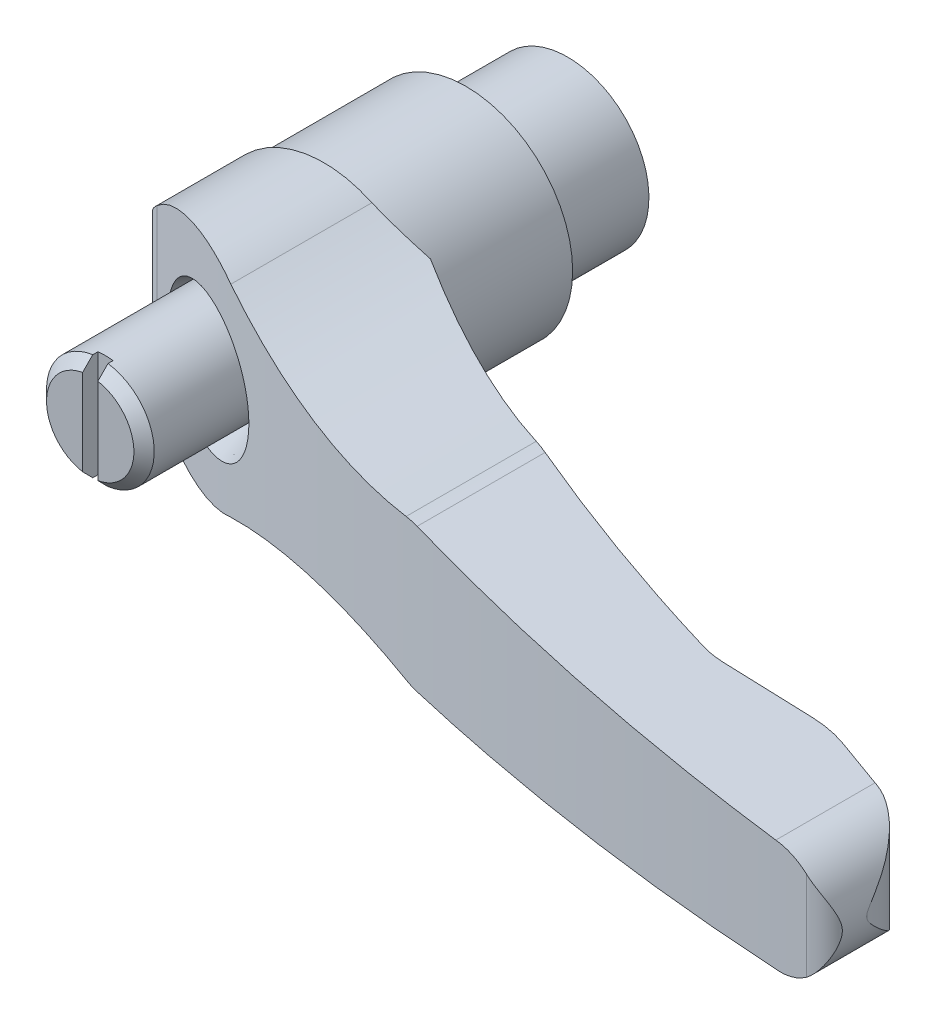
ISO-10303-21;
HEADER;
FILE_DESCRIPTION(('STEP AP214'),'2;1');
FILE_NAME('part.step','',(''),(''),'','','');
FILE_SCHEMA(('AUTOMOTIVE_DESIGN { 1 0 10303 214 1 1 1 1 }'));
ENDSEC;
DATA;
#1=APPLICATION_CONTEXT('core data for automotive mechanical design processes');
#2=APPLICATION_PROTOCOL_DEFINITION('international standard','automotive_design',2000,#1);
#3=PRODUCT_CONTEXT('',#1,'mechanical');
#4=PRODUCT('Part','Part','',(#3));
#5=PRODUCT_RELATED_PRODUCT_CATEGORY('part','',(#4));
#6=PRODUCT_DEFINITION_FORMATION('','',#4);
#7=PRODUCT_DEFINITION_CONTEXT('part definition',#1,'design');
#8=PRODUCT_DEFINITION('design','',#6,#7);
#9=PRODUCT_DEFINITION_SHAPE('','',#8);
#10=(LENGTH_UNIT() NAMED_UNIT(*) SI_UNIT(.MILLI.,.METRE.));
#11=(NAMED_UNIT(*) PLANE_ANGLE_UNIT() SI_UNIT($,.RADIAN.));
#12=(NAMED_UNIT(*) SI_UNIT($,.STERADIAN.) SOLID_ANGLE_UNIT());
#13=UNCERTAINTY_MEASURE_WITH_UNIT(LENGTH_MEASURE(1.E-05),#10,'distance_accuracy_value','');
#14=(GEOMETRIC_REPRESENTATION_CONTEXT(3) GLOBAL_UNCERTAINTY_ASSIGNED_CONTEXT((#13)) GLOBAL_UNIT_ASSIGNED_CONTEXT((#10,
#11,#12)) REPRESENTATION_CONTEXT('',''));
#15=CARTESIAN_POINT('',(0.,0.,0.));
#16=DIRECTION('',(0.,0.,1.));
#17=DIRECTION('',(1.,0.,0.));
#18=AXIS2_PLACEMENT_3D('',#15,#16,#17);
#19=CARTESIAN_POINT('',(-0.010000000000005,0.,27.8125));
#20=DIRECTION('',(0.,0.,-1.));
#21=DIRECTION('',(1.,0.,0.));
#22=AXIS2_PLACEMENT_3D('',#19,#20,#21);
#23=CYLINDRICAL_SURFACE('',#22,10.5);
#24=CARTESIAN_POINT('',(-0.0100000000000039,0.,24.));
#25=DIRECTION('',(0.,0.,1.));
#26=DIRECTION('',(0.,-1.,0.));
#27=AXIS2_PLACEMENT_3D('',#24,#25,#26);
#28=CIRCLE('',#27,10.5);
#29=CARTESIAN_POINT('',(-10.51,0.,24.));
#30=VERTEX_POINT('',#29);
#31=CARTESIAN_POINT('',(10.49,0.,24.));
#32=VERTEX_POINT('',#31);
#33=EDGE_CURVE('E219',#30,#32,#28,.T.);
#34=ORIENTED_EDGE('',*,*,#33,.F.);
#35=EDGE_CURVE('E218',#32,#30,#28,.T.);
#36=ORIENTED_EDGE('',*,*,#35,.F.);
#37=EDGE_LOOP('',(#34,#36));
#38=FACE_BOUND('',#37,.T.);
#39=CARTESIAN_POINT('',(-0.00999999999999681,0.,-0.250037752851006));
#40=DIRECTION('',(0.707106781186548,0.,0.707106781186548));
#41=DIRECTION('',(0.707106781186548,0.,-0.707106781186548));
#42=AXIS2_PLACEMENT_3D('',#39,#40,#41);
#43=ELLIPSE('',#42,14.8492424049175,10.5);
#44=CARTESIAN_POINT('',(-10.260037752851,-2.27743848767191,10.));
#45=VERTEX_POINT('',#44);
#46=CARTESIAN_POINT('',(-10.260037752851,2.27743848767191,10.));
#47=VERTEX_POINT('',#46);
#48=EDGE_CURVE('E475',#45,#47,#43,.F.);
#49=ORIENTED_EDGE('',*,*,#48,.F.);
#50=CARTESIAN_POINT('',(-0.0099999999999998,0.,10.));
#51=DIRECTION('',(0.,0.,-1.));
#52=DIRECTION('',(1.,0.,0.));
#53=AXIS2_PLACEMENT_3D('',#50,#51,#52);
#54=CIRCLE('',#53,10.5);
#55=EDGE_CURVE('E30',#47,#45,#54,.T.);
#56=ORIENTED_EDGE('',*,*,#55,.F.);
#57=EDGE_LOOP('',(#49,#56));
#58=FACE_BOUND('',#57,.T.);
#59=ADVANCED_FACE('F14',(#38,#58),#23,.T.);
#60=CARTESIAN_POINT('',(-10.51,-22.,10.249962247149));
#61=DIRECTION('',(0.707106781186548,0.,0.707106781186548));
#62=DIRECTION('',(-0.707106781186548,0.,0.707106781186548));
#63=AXIS2_PLACEMENT_3D('',#60,#61,#62);
#64=PLANE('',#63);
#65=ORIENTED_EDGE('',*,*,#48,.T.);
#66=DIRECTION('',(0.,1.,0.));
#67=VECTOR('',#66,1.);
#68=CARTESIAN_POINT('',(-10.260037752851,-22.,10.));
#69=LINE('',#68,#67);
#70=EDGE_CURVE('E83',#45,#47,#69,.T.);
#71=ORIENTED_EDGE('',*,*,#70,.F.);
#72=EDGE_LOOP('',(#65,#71));
#73=FACE_BOUND('',#72,.T.);
#74=ADVANCED_FACE('F459',(#73),#64,.F.);
#75=CARTESIAN_POINT('',(-0.0099999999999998,0.,10.));
#76=DIRECTION('',(0.,0.,-1.));
#77=DIRECTION('',(1.,0.,0.));
#78=AXIS2_PLACEMENT_3D('',#75,#76,#77);
#79=PLANE('',#78);
#80=CARTESIAN_POINT('',(0.,0.,10.));
#81=DIRECTION('',(0.,0.,-1.));
#82=DIRECTION('',(1.,0.,0.));
#83=AXIS2_PLACEMENT_3D('',#80,#81,#82);
#84=CIRCLE('',#83,8.3);
#85=CARTESIAN_POINT('',(8.3,0.,10.));
#86=VERTEX_POINT('',#85);
#87=EDGE_CURVE('E353',#86,#86,#84,.T.);
#88=ORIENTED_EDGE('',*,*,#87,.F.);
#89=EDGE_LOOP('',(#88));
#90=FACE_BOUND('',#89,.T.);
#91=ORIENTED_EDGE('',*,*,#70,.T.);
#92=ORIENTED_EDGE('',*,*,#55,.T.);
#93=EDGE_LOOP('',(#91,#92));
#94=FACE_BOUND('',#93,.T.);
#95=ADVANCED_FACE('F460',(#90,#94),#79,.T.);
#96=CARTESIAN_POINT('',(0.,0.,10.));
#97=DIRECTION('',(0.,0.,1.));
#98=DIRECTION('',(0.,-1.,0.));
#99=AXIS2_PLACEMENT_3D('',#96,#97,#98);
#100=CYLINDRICAL_SURFACE('',#99,8.3);
#101=ORIENTED_EDGE('',*,*,#87,.T.);
#102=EDGE_LOOP('',(#101));
#103=FACE_BOUND('',#102,.T.);
#104=CARTESIAN_POINT('',(0.,0.,10.4));
#105=DIRECTION('',(0.,0.,1.));
#106=DIRECTION('',(0.,-1.,0.));
#107=AXIS2_PLACEMENT_3D('',#104,#105,#106);
#108=CIRCLE('',#107,8.3);
#109=CARTESIAN_POINT('',(0.,-8.3,10.4));
#110=VERTEX_POINT('',#109);
#111=EDGE_CURVE('E1079',#110,#110,#108,.T.);
#112=ORIENTED_EDGE('',*,*,#111,.T.);
#113=EDGE_LOOP('',(#112));
#114=FACE_BOUND('',#113,.T.);
#115=ADVANCED_FACE('F462',(#103,#114),#100,.F.);
#116=CARTESIAN_POINT('',(0.,0.,10.7));
#117=DIRECTION('',(0.,0.,-1.));
#118=DIRECTION('',(0.,1.,0.));
#119=AXIS2_PLACEMENT_3D('',#116,#117,#118);
#120=CONICAL_SURFACE('',#119,8.,0.785398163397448);
#121=ORIENTED_EDGE('',*,*,#111,.F.);
#122=EDGE_LOOP('',(#121));
#123=FACE_BOUND('',#122,.T.);
#124=CARTESIAN_POINT('',(0.,0.,10.7));
#125=DIRECTION('',(0.,0.,1.));
#126=DIRECTION('',(0.,-1.,0.));
#127=AXIS2_PLACEMENT_3D('',#124,#125,#126);
#128=CIRCLE('',#127,8.);
#129=CARTESIAN_POINT('',(0.,-8.,10.7));
#130=VERTEX_POINT('',#129);
#131=EDGE_CURVE('E481',#130,#130,#128,.T.);
#132=ORIENTED_EDGE('',*,*,#131,.T.);
#133=EDGE_LOOP('',(#132));
#134=FACE_BOUND('',#133,.T.);
#135=ADVANCED_FACE('F413',(#123,#134),#120,.F.);
#136=CARTESIAN_POINT('',(57.3760512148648,-12.,33.4699999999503));
#137=DIRECTION('',(0.,1.,0.));
#138=DIRECTION('',(-1.,0.,0.));
#139=AXIS2_PLACEMENT_3D('',#136,#137,#138);
#140=CYLINDRICAL_SURFACE('',#139,8.59000000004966);
#141=CARTESIAN_POINT('',(57.3760512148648,6.11892873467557,33.4699999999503));
#142=DIRECTION('',(0.0361204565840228,0.999347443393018,0.));
#143=DIRECTION('',(-0.999347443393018,0.0361204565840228,0.));
#144=AXIS2_PLACEMENT_3D('',#141,#142,#143);
#145=ELLIPSE('',#144,8.59560912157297,8.59000000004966);
#146=CARTESIAN_POINT('',(57.37605121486,6.11892873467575,42.06));
#147=VERTEX_POINT('',#146);
#148=CARTESIAN_POINT('',(55.1138126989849,6.20069518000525,41.7567591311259));
#149=VERTEX_POINT('',#148);
#150=EDGE_CURVE('E569',#147,#149,#145,.F.);
#151=ORIENTED_EDGE('',*,*,#150,.F.);
#152=DIRECTION('',(0.,1.,0.));
#153=VECTOR('',#152,1.);
#154=CARTESIAN_POINT('',(57.37605121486,-12.,42.06));
#155=LINE('',#154,#153);
#156=CARTESIAN_POINT('',(57.37605121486,-6.11892873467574,42.06));
#157=VERTEX_POINT('',#156);
#158=EDGE_CURVE('E235',#157,#147,#155,.T.);
#159=ORIENTED_EDGE('',*,*,#158,.F.);
#160=CARTESIAN_POINT('',(57.3760512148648,-6.11892873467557,33.4699999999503));
#161=DIRECTION('',(0.0361204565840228,-0.999347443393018,0.));
#162=DIRECTION('',(0.999347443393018,0.0361204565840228,0.));
#163=AXIS2_PLACEMENT_3D('',#160,#161,#162);
#164=ELLIPSE('',#163,8.59560912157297,8.59000000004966);
#165=CARTESIAN_POINT('',(55.1138126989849,-6.20069518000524,41.7567591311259));
#166=VERTEX_POINT('',#165);
#167=EDGE_CURVE('E567',#166,#157,#164,.F.);
#168=ORIENTED_EDGE('',*,*,#167,.F.);
#169=DIRECTION('',(0.,1.,0.));
#170=VECTOR('',#169,1.);
#171=CARTESIAN_POINT('',(55.1138126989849,-12.,41.7567591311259));
#172=LINE('',#171,#170);
#173=EDGE_CURVE('E233',#166,#149,#172,.T.);
#174=ORIENTED_EDGE('',*,*,#173,.T.);
#175=EDGE_LOOP('',(#151,#159,#168,#174));
#176=FACE_BOUND('',#175,.T.);
#177=ADVANCED_FACE('F409',(#176),#140,.F.);
#178=CARTESIAN_POINT('',(57.37605121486,-12.,42.06));
#179=DIRECTION('',(0.,0.,1.));
#180=DIRECTION('',(0.,-1.,0.));
#181=AXIS2_PLACEMENT_3D('',#178,#179,#180);
#182=PLANE('',#181);
#183=DIRECTION('',(-0.999347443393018,0.0361204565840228,0.));
#184=VECTOR('',#183,1.);
#185=CARTESIAN_POINT('',(58.0300881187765,6.09528919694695,42.06));
#186=LINE('',#185,#184);
#187=CARTESIAN_POINT('',(66.163324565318,5.80132115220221,42.06));
#188=VERTEX_POINT('',#187);
#189=EDGE_CURVE('E563',#188,#147,#186,.T.);
#190=ORIENTED_EDGE('',*,*,#189,.F.);
#191=DIRECTION('',(0.,1.,0.));
#192=VECTOR('',#191,1.);
#193=CARTESIAN_POINT('',(66.163324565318,-12.,42.06));
#194=LINE('',#193,#192);
#195=CARTESIAN_POINT('',(66.163324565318,-5.80132115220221,42.06));
#196=VERTEX_POINT('',#195);
#197=EDGE_CURVE('E556',#196,#188,#194,.T.);
#198=ORIENTED_EDGE('',*,*,#197,.F.);
#199=DIRECTION('',(0.999347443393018,0.0361204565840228,0.));
#200=VECTOR('',#199,1.);
#201=CARTESIAN_POINT('',(57.1637628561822,-6.12660169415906,42.06));
#202=LINE('',#201,#200);
#203=EDGE_CURVE('E564',#157,#196,#202,.T.);
#204=ORIENTED_EDGE('',*,*,#203,.F.);
#205=ORIENTED_EDGE('',*,*,#158,.T.);
#206=EDGE_LOOP('',(#190,#198,#204,#205));
#207=FACE_BOUND('',#206,.T.);
#208=ADVANCED_FACE('F405',(#207),#182,.F.);
#209=CARTESIAN_POINT('',(66.1633245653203,-12.,53.3399999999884));
#210=DIRECTION('',(0.,1.,0.));
#211=DIRECTION('',(-1.,0.,0.));
#212=AXIS2_PLACEMENT_3D('',#209,#210,#211);
#213=CYLINDRICAL_SURFACE('',#212,11.2799999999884);
#214=CARTESIAN_POINT('',(66.1633245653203,5.80132115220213,53.3399999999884));
#215=DIRECTION('',(0.0361204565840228,0.999347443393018,0.));
#216=DIRECTION('',(-0.999347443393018,0.0361204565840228,0.));
#217=AXIS2_PLACEMENT_3D('',#214,#215,#216);
#218=ELLIPSE('',#217,11.2873656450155,11.2799999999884);
#219=CARTESIAN_POINT('',(69.761185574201,5.6712799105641,42.649172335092));
#220=VERTEX_POINT('',#219);
#221=EDGE_CURVE('E570',#220,#188,#218,.T.);
#222=ORIENTED_EDGE('',*,*,#221,.F.);
#223=DIRECTION('',(0.,1.,0.));
#224=VECTOR('',#223,1.);
#225=CARTESIAN_POINT('',(69.761185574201,-12.,42.649172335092));
#226=LINE('',#225,#224);
#227=CARTESIAN_POINT('',(69.761185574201,-5.6712799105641,42.649172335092));
#228=VERTEX_POINT('',#227);
#229=EDGE_CURVE('E553',#228,#220,#226,.T.);
#230=ORIENTED_EDGE('',*,*,#229,.F.);
#231=CARTESIAN_POINT('',(66.1633245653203,-5.80132115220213,53.3399999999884));
#232=DIRECTION('',(0.0361204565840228,-0.999347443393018,0.));
#233=DIRECTION('',(0.999347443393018,0.0361204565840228,0.));
#234=AXIS2_PLACEMENT_3D('',#231,#232,#233);
#235=ELLIPSE('',#234,11.2873656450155,11.2799999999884);
#236=EDGE_CURVE('E590',#196,#228,#235,.T.);
#237=ORIENTED_EDGE('',*,*,#236,.F.);
#238=ORIENTED_EDGE('',*,*,#197,.T.);
#239=EDGE_LOOP('',(#222,#230,#237,#238));
#240=FACE_BOUND('',#239,.T.);
#241=ADVANCED_FACE('F402',(#240),#213,.T.);
#242=CARTESIAN_POINT('',(111.590768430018,-12.,-165.122809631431));
#243=DIRECTION('',(0.,1.,0.));
#244=DIRECTION('',(-1.,0.,0.));
#245=AXIS2_PLACEMENT_3D('',#242,#243,#244);
#246=CYLINDRICAL_SURFACE('',#245,214.450000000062);
#247=CARTESIAN_POINT('',(30.179428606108,-6.9666323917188,33.2732494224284));
#248=CARTESIAN_POINT('',(30.4222007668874,-7.0028281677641,33.3728739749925));
#249=CARTESIAN_POINT('',(30.6665043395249,-7.02781937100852,33.472598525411));
#250=CARTESIAN_POINT('',(31.033921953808,-7.04840105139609,33.6217860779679));
#251=CARTESIAN_POINT('',(31.1565128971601,-7.05244559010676,33.6714318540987));
#252=CARTESIAN_POINT('',(31.4020580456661,-7.05489552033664,33.7706062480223));
#253=CARTESIAN_POINT('',(31.5250125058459,-7.05329063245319,33.820134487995));
#254=CARTESIAN_POINT('',(31.647932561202,-7.0488469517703,33.8695155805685));
#255=B_SPLINE_CURVE_WITH_KNOTS('',3,(#247,#248,#249,#250,#251,#252,#253,#254),.UNSPECIFIED.,.F.,
.F.,(4,2,2,4),(0.,0.794258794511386,1.19111760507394,1.58869889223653),.UNSPECIFIED.);
#256=CARTESIAN_POINT('',(30.179428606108,-6.9666323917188,33.2732494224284));
#257=VERTEX_POINT('',#256);
#258=CARTESIAN_POINT('',(31.647932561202,-7.0488469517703,33.8695155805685));
#259=VERTEX_POINT('',#258);
#260=EDGE_CURVE('E431',#257,#259,#255,.T.);
#261=ORIENTED_EDGE('',*,*,#260,.F.);
#262=CARTESIAN_POINT('',(10.49,-8.03465812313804,24.));
#263=CARTESIAN_POINT('',(11.2781269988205,-7.82806345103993,24.4213315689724));
#264=CARTESIAN_POINT('',(12.0728488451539,-7.64070973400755,24.8398212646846));
#265=CARTESIAN_POINT('',(13.6740672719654,-7.30530099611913,25.6700985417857));
#266=CARTESIAN_POINT('',(14.4805646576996,-7.15724867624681,26.0818856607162));
#267=CARTESIAN_POINT('',(16.0966341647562,-6.90241973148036,26.8940746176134));
#268=CARTESIAN_POINT('',(16.906116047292,-6.79528972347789,27.2945449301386));
#269=CARTESIAN_POINT('',(18.5335723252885,-6.62127786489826,28.0868684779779));
#270=CARTESIAN_POINT('',(19.3515465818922,-6.55439535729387,28.4787218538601));
#271=CARTESIAN_POINT('',(20.9944633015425,-6.46166065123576,29.2529521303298));
#272=CARTESIAN_POINT('',(21.8194069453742,-6.43581555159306,29.6353273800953));
#273=CARTESIAN_POINT('',(23.474294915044,-6.42593469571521,30.3896366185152));
#274=CARTESIAN_POINT('',(24.3042391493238,-6.44189817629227,30.7615707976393));
#275=CARTESIAN_POINT('',(25.974600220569,-6.51667337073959,31.497417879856));
#276=CARTESIAN_POINT('',(26.8150445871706,-6.57586454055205,31.8612301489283));
#277=CARTESIAN_POINT('',(28.4970001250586,-6.7381558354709,32.5766232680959));
#278=CARTESIAN_POINT('',(29.3385114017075,-6.84126069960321,32.9282027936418));
#279=CARTESIAN_POINT('',(30.179428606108,-6.96663239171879,33.2732494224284));
#280=B_SPLINE_CURVE_WITH_KNOTS('',3,(#262,#263,#264,#265,#266,#267,#268,#269,#270,#271,#272,
#273,#274,#275,#276,#277,#278,#279),.UNSPECIFIED.,.F.,.F.,(4,2,2,2,2,2,2,2,4),(0.,
2.7515590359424,5.50330712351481,8.23072437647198,10.9580971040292,13.6859415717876,
16.4137362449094,19.1657679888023,21.9180967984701),.UNSPECIFIED.);
#281=CARTESIAN_POINT('',(10.49,-8.03465812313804,24.));
#282=VERTEX_POINT('',#281);
#283=EDGE_CURVE('E209',#282,#257,#280,.T.);
#284=ORIENTED_EDGE('',*,*,#283,.F.);
#285=DIRECTION('',(0.,1.,0.));
#286=VECTOR('',#285,1.);
#287=CARTESIAN_POINT('',(10.49,-12.,24.));
#288=LINE('',#287,#286);
#289=EDGE_CURVE('E202',#282,#32,#288,.T.);
#290=ORIENTED_EDGE('',*,*,#289,.T.);
#291=CARTESIAN_POINT('',(10.49,8.03465812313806,24.));
#292=VERTEX_POINT('',#291);
#293=EDGE_CURVE('E208',#32,#292,#288,.T.);
#294=ORIENTED_EDGE('',*,*,#293,.T.);
#295=CARTESIAN_POINT('',(30.179428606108,6.9666323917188,33.2732494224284));
#296=CARTESIAN_POINT('',(29.3385114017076,6.84126069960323,32.9282027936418));
#297=CARTESIAN_POINT('',(28.4970001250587,6.73815583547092,32.5766232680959));
#298=CARTESIAN_POINT('',(26.8150445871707,6.57586454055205,31.8612301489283));
#299=CARTESIAN_POINT('',(25.974600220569,6.51667337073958,31.497417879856));
#300=CARTESIAN_POINT('',(24.3042391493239,6.44189817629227,30.7615707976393));
#301=CARTESIAN_POINT('',(23.4742949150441,6.42593469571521,30.3896366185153));
#302=CARTESIAN_POINT('',(21.8194069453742,6.43581555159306,29.6353273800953));
#303=CARTESIAN_POINT('',(20.9944633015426,6.46166065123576,29.2529521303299));
#304=CARTESIAN_POINT('',(19.3515465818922,6.55439535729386,28.4787218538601));
#305=CARTESIAN_POINT('',(18.5335723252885,6.62127786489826,28.0868684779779));
#306=CARTESIAN_POINT('',(16.906116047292,6.79528972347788,27.2945449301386));
#307=CARTESIAN_POINT('',(16.0966341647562,6.90241973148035,26.8940746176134));
#308=CARTESIAN_POINT('',(14.4805646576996,7.15724867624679,26.0818856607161));
#309=CARTESIAN_POINT('',(13.6740672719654,7.30530099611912,25.6700985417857));
#310=CARTESIAN_POINT('',(12.0728488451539,7.64070973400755,24.8398212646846));
#311=CARTESIAN_POINT('',(11.2781269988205,7.82806345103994,24.4213315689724));
#312=CARTESIAN_POINT('',(10.49,8.03465812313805,24.));
#313=B_SPLINE_CURVE_WITH_KNOTS('',3,(#295,#296,#297,#298,#299,#300,#301,#302,#303,#304,#305,
#306,#307,#308,#309,#310,#311,#312),.UNSPECIFIED.,.F.,.F.,(4,2,2,2,2,2,2,2,4),(0.,
2.75232880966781,5.50436055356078,8.23215522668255,10.9599996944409,13.6873724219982,
16.4147896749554,19.1665377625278,21.9180967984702),.UNSPECIFIED.);
#314=CARTESIAN_POINT('',(30.179428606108,6.9666323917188,33.2732494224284));
#315=VERTEX_POINT('',#314);
#316=EDGE_CURVE('E444',#315,#292,#313,.T.);
#317=ORIENTED_EDGE('',*,*,#316,.F.);
#318=CARTESIAN_POINT('',(31.647932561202,7.0488469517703,33.8695155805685));
#319=CARTESIAN_POINT('',(31.5250125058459,7.05329063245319,33.820134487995));
#320=CARTESIAN_POINT('',(31.4020580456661,7.05489552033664,33.7706062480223));
#321=CARTESIAN_POINT('',(31.1565128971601,7.05244559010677,33.6714318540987));
#322=CARTESIAN_POINT('',(31.033921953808,7.04840105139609,33.6217860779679));
#323=CARTESIAN_POINT('',(30.666504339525,7.02781937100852,33.472598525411));
#324=CARTESIAN_POINT('',(30.4222007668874,7.0028281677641,33.3728739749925));
#325=CARTESIAN_POINT('',(30.179428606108,6.9666323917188,33.2732494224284));
#326=B_SPLINE_CURVE_WITH_KNOTS('',3,(#318,#319,#320,#321,#322,#323,#324,#325),.UNSPECIFIED.,.F.,
.F.,(4,2,2,4),(0.,0.39758128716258,0.794440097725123,1.58869889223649),.UNSPECIFIED.);
#327=CARTESIAN_POINT('',(31.647932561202,7.0488469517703,33.8695155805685));
#328=VERTEX_POINT('',#327);
#329=EDGE_CURVE('E438',#328,#315,#326,.T.);
#330=ORIENTED_EDGE('',*,*,#329,.F.);
#331=CARTESIAN_POINT('',(111.590768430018,4.15938968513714,-165.122809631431));
#332=DIRECTION('',(0.0361204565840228,0.999347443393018,0.));
#333=DIRECTION('',(-0.999347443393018,0.0361204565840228,0.));
#334=AXIS2_PLACEMENT_3D('',#331,#332,#333);
#335=ELLIPSE('',#334,214.590032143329,214.450000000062);
#336=EDGE_CURVE('E445',#149,#328,#335,.F.);
#337=ORIENTED_EDGE('',*,*,#336,.F.);
#338=ORIENTED_EDGE('',*,*,#173,.F.);
#339=CARTESIAN_POINT('',(111.590768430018,-4.15938968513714,-165.122809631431));
#340=DIRECTION('',(0.0361204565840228,-0.999347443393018,0.));
#341=DIRECTION('',(0.999347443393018,0.0361204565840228,0.));
#342=AXIS2_PLACEMENT_3D('',#339,#340,#341);
#343=ELLIPSE('',#342,214.590032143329,214.450000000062);
#344=EDGE_CURVE('E595',#259,#166,#343,.F.);
#345=ORIENTED_EDGE('',*,*,#344,.F.);
#346=EDGE_LOOP('',(#261,#284,#290,#294,#317,#330,#337,#338,#345));
#347=FACE_BOUND('',#346,.T.);
#348=ADVANCED_FACE('F205',(#347),#246,.F.);
#349=CARTESIAN_POINT('',(79.996705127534,-12.,50.539592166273));
#350=DIRECTION('',(-0.99233193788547,0.,0.123601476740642));
#351=DIRECTION('',(-0.123601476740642,0.,-0.99233193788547));
#352=AXIS2_PLACEMENT_3D('',#349,#350,#351);
#353=PLANE('',#352);
#354=CARTESIAN_POINT('',(74.5,0.,6.40940703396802));
#355=DIRECTION('',(-0.99233193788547,0.,0.123601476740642));
#356=DIRECTION('',(0.123601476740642,0.,0.99233193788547));
#357=AXIS2_PLACEMENT_3D('',#354,#355,#356);
#358=ELLIPSE('',#357,44.4978502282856,5.5);
#359=CARTESIAN_POINT('',(79.996705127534,-0.190348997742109,50.539592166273));
#360=VERTEX_POINT('',#359);
#361=CARTESIAN_POINT('',(79.996705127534,0.190348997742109,50.539592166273));
#362=VERTEX_POINT('',#361);
#363=EDGE_CURVE('E385',#360,#362,#358,.T.);
#364=ORIENTED_EDGE('',*,*,#363,.F.);
#365=DIRECTION('',(0.,1.,0.));
#366=VECTOR('',#365,1.);
#367=CARTESIAN_POINT('',(79.996705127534,-12.,50.539592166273));
#368=LINE('',#367,#366);
#369=EDGE_CURVE('E547',#360,#362,#368,.T.);
#370=ORIENTED_EDGE('',*,*,#369,.T.);
#371=EDGE_LOOP('',(#364,#370));
#372=FACE_BOUND('',#371,.T.);
#373=ADVANCED_FACE('F396',(#372),#353,.F.);
#374=CARTESIAN_POINT('',(72.6137555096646,-12.,51.4591871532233));
#375=DIRECTION('',(0.,1.,0.));
#376=DIRECTION('',(-1.,0.,0.));
#377=AXIS2_PLACEMENT_3D('',#374,#375,#376);
#378=CYLINDRICAL_SURFACE('',#377,7.44000000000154);
#379=CARTESIAN_POINT('',(74.986812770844,-5.47841339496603,44.407790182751));
#380=CARTESIAN_POINT('',(75.1398120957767,-5.4648402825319,44.4592429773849));
#381=CARTESIAN_POINT('',(75.2905169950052,-5.44496899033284,44.5155387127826));
#382=CARTESIAN_POINT('',(75.5860882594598,-5.39377415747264,44.6368581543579));
#383=CARTESIAN_POINT('',(75.730963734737,-5.36246932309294,44.7018674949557));
#384=CARTESIAN_POINT('',(76.0125967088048,-5.2898955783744,44.839081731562));
#385=CARTESIAN_POINT('',(76.149425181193,-5.248738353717,44.9112009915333));
#386=CARTESIAN_POINT('',(76.4161065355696,-5.1573648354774,45.062373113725));
#387=CARTESIAN_POINT('',(76.5459558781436,-5.10714400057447,45.1414294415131));
#388=CARTESIAN_POINT('',(76.827653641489,-4.98604991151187,45.3247681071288));
#389=CARTESIAN_POINT('',(76.9775772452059,-4.91309116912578,45.4306358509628));
#390=CARTESIAN_POINT('',(77.2657899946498,-4.75681575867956,45.6501400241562));
#391=CARTESIAN_POINT('',(77.4040776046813,-4.67349772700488,45.7637774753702));
#392=CARTESIAN_POINT('',(77.8028296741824,-4.40945601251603,46.1156758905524));
#393=CARTESIAN_POINT('',(78.0457801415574,-4.21527563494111,46.3639882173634));
#394=CARTESIAN_POINT('',(78.4176945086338,-3.86589184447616,46.7984433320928));
#395=CARTESIAN_POINT('',(78.558647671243,-3.71726415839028,46.9799982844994));
#396=CARTESIAN_POINT('',(78.8199419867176,-3.41009407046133,47.3496806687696));
#397=CARTESIAN_POINT('',(78.9402736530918,-3.25154715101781,47.5378110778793));
#398=CARTESIAN_POINT('',(79.1607378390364,-2.92676895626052,47.9181651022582));
#399=CARTESIAN_POINT('',(79.2609186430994,-2.76055725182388,48.1103776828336));
#400=CARTESIAN_POINT('',(79.4421677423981,-2.42115236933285,48.497428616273));
#401=CARTESIAN_POINT('',(79.5232445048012,-2.24796232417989,48.6922657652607));
#402=CARTESIAN_POINT('',(79.657896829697,-1.91676087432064,49.0578102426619));
#403=CARTESIAN_POINT('',(79.713648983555,-1.75958096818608,49.2284695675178));
#404=CARTESIAN_POINT('',(79.7869638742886,-1.51825146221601,49.4826945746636));
#405=CARTESIAN_POINT('',(79.8097141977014,-1.43673320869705,49.5672896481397));
#406=CARTESIAN_POINT('',(79.8517302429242,-1.27132927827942,49.7350141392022));
#407=CARTESIAN_POINT('',(79.8709966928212,-1.18744410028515,49.8181438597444));
#408=CARTESIAN_POINT('',(79.907186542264,-1.01046435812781,49.986973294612));
#409=CARTESIAN_POINT('',(79.9238666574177,-0.917129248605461,50.0724723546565));
#410=CARTESIAN_POINT('',(79.9529450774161,-0.724505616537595,50.2358460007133));
#411=CARTESIAN_POINT('',(79.9653823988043,-0.625281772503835,50.3137850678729));
#412=CARTESIAN_POINT('',(79.9802376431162,-0.46858024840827,50.4153149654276));
#413=CARTESIAN_POINT('',(79.9845030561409,-0.416215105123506,50.4460963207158));
#414=CARTESIAN_POINT('',(79.9917045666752,-0.306879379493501,50.4998809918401));
#415=CARTESIAN_POINT('',(79.9946243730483,-0.249861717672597,50.522788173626));
#416=CARTESIAN_POINT('',(79.996705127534,-0.190348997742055,50.539592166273));
#417=B_SPLINE_CURVE_WITH_KNOTS('',3,(#379,#380,#381,#382,#383,#384,#385,#386,#387,#388,#389,
#390,#391,#392,#393,#394,#395,#396,#397,#398,#399,#400,#401,#402,#403,#404,#405,#406,#407,#408,
#409,#410,#411,#412,#413,#414,#415,#416),.UNSPECIFIED.,.F.,.F.,(4,2,2,2,2,2,2,2,2,2,2,2,2,2,2,2,
2,2,4),(0.,0.485611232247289,0.970431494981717,1.44999646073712,1.92980238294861,
2.52141817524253,3.11311192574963,4.30183389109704,5.12208341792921,5.94270927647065,
6.76134473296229,7.57961667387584,8.29494630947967,8.65387747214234,9.01273353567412,
9.39561932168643,9.77488268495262,9.95698827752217,10.1412441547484),.UNSPECIFIED.);
#418=CARTESIAN_POINT('',(74.986812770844,-5.47841339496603,44.407790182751));
#419=VERTEX_POINT('',#418);
#420=EDGE_CURVE('E384',#419,#360,#417,.T.);
#421=ORIENTED_EDGE('',*,*,#420,.F.);
#422=DIRECTION('',(0.,1.,0.));
#423=VECTOR('',#422,1.);
#424=CARTESIAN_POINT('',(74.986812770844,-12.,44.407790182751));
#425=LINE('',#424,#423);
#426=CARTESIAN_POINT('',(74.986812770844,5.47841339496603,44.407790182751));
#427=VERTEX_POINT('',#426);
#428=EDGE_CURVE('E550',#419,#427,#425,.T.);
#429=ORIENTED_EDGE('',*,*,#428,.T.);
#430=CARTESIAN_POINT('',(79.996705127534,0.190348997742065,50.539592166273));
#431=CARTESIAN_POINT('',(79.9951469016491,0.235214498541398,50.5270575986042));
#432=CARTESIAN_POINT('',(79.9930953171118,0.278736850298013,50.5108629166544));
#433=CARTESIAN_POINT('',(79.9881648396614,0.363077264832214,50.47327081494));
#434=CARTESIAN_POINT('',(79.9852922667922,0.403913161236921,50.451913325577));
#435=CARTESIAN_POINT('',(79.9757020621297,0.522458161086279,50.3833482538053));
#436=CARTESIAN_POINT('',(79.9679715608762,0.597169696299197,50.3312876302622));
#437=CARTESIAN_POINT('',(79.950886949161,0.736456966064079,50.225155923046));
#438=CARTESIAN_POINT('',(79.9416856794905,0.801375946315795,50.1714851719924));
#439=CARTESIAN_POINT('',(79.9214540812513,0.928420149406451,50.0612288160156));
#440=CARTESIAN_POINT('',(79.9104232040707,0.990544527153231,50.0046423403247));
#441=CARTESIAN_POINT('',(79.8746515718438,1.17419942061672,49.832312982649));
#442=CARTESIAN_POINT('',(79.847248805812,1.29287988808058,49.7141099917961));
#443=CARTESIAN_POINT('',(79.7848398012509,1.52823594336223,49.4729704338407));
#444=CARTESIAN_POINT('',(79.749692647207,1.64482416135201,49.3499864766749));
#445=CARTESIAN_POINT('',(79.6721004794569,1.8745831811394,49.1033284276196));
#446=CARTESIAN_POINT('',(79.6296610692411,1.98775652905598,48.9796549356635));
#447=CARTESIAN_POINT('',(79.5033816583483,2.29352791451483,48.641550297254));
#448=CARTESIAN_POINT('',(79.4120558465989,2.48329449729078,48.4272966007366));
#449=CARTESIAN_POINT('',(79.2061355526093,2.85434488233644,48.0023120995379));
#450=CARTESIAN_POINT('',(79.0915236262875,3.03562219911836,47.791584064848));
#451=CARTESIAN_POINT('',(78.8390032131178,3.38665877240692,47.3777391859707));
#452=CARTESIAN_POINT('',(78.7012752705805,3.5564939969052,47.174577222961));
#453=CARTESIAN_POINT('',(78.4009143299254,3.88356808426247,46.7768350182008));
#454=CARTESIAN_POINT('',(78.2383021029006,4.04081728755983,46.5822477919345));
#455=CARTESIAN_POINT('',(77.9568022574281,4.28016983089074,46.2794503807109));
#456=CARTESIAN_POINT('',(77.8461272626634,4.36735584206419,46.1675710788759));
#457=CARTESIAN_POINT('',(77.615129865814,4.53501217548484,45.9487274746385));
#458=CARTESIAN_POINT('',(77.4948054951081,4.61548112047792,45.8417641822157));
#459=CARTESIAN_POINT('',(77.2447591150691,4.76840923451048,45.633916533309));
#460=CARTESIAN_POINT('',(77.1150589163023,4.84088606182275,45.5330190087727));
#461=CARTESIAN_POINT('',(76.846172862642,4.97676025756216,45.3380932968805));
#462=CARTESIAN_POINT('',(76.7069926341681,5.04016294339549,45.2440611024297));
#463=CARTESIAN_POINT('',(76.4438690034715,5.14664435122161,45.079244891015));
#464=CARTESIAN_POINT('',(76.3213555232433,5.19134589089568,45.0072256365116));
#465=CARTESIAN_POINT('',(76.0703754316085,5.27269544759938,44.8693561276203));
#466=CARTESIAN_POINT('',(75.9419112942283,5.30934677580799,44.803503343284));
#467=CARTESIAN_POINT('',(75.6784961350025,5.3739797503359,44.6781572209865));
#468=CARTESIAN_POINT('',(75.5435027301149,5.40189236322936,44.618716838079));
#469=CARTESIAN_POINT('',(75.268600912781,5.44782102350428,44.5073869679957));
#470=CARTESIAN_POINT('',(75.1286862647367,5.46582399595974,44.4555075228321));
#471=CARTESIAN_POINT('',(74.986812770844,5.47841339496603,44.407790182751));
#472=B_SPLINE_CURVE_WITH_KNOTS('',3,(#430,#431,#432,#433,#434,#435,#436,#437,#438,#439,#440,
#441,#442,#443,#444,#445,#446,#447,#448,#449,#450,#451,#452,#453,#454,#455,#456,#457,#458,#459,
#460,#461,#462,#463,#464,#465,#466,#467,#468,#469,#470,#471),.UNSPECIFIED.,.F.,.F.,(4,2,2,2,2,2,
2,2,2,2,2,2,2,2,2,2,2,2,2,2,4),(0.,0.139245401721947,0.277446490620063,0.550810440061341,
0.804906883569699,1.05907965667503,1.56794086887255,2.08696422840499,2.60559053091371,
3.50582150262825,4.4067293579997,5.30090298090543,6.19433426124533,6.73367946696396,
7.27313498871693,7.81137365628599,8.34929561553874,8.7958064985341,9.24213337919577,
9.69190199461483,10.1422626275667),.UNSPECIFIED.);
#473=EDGE_CURVE('E378',#362,#427,#472,.T.);
#474=ORIENTED_EDGE('',*,*,#473,.F.);
#475=ORIENTED_EDGE('',*,*,#369,.F.);
#476=EDGE_LOOP('',(#421,#429,#474,#475));
#477=FACE_BOUND('',#476,.T.);
#478=ADVANCED_FACE('F391',(#477),#378,.T.);
#479=CARTESIAN_POINT('',(69.761185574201,-12.,42.649172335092));
#480=DIRECTION('',(-0.318959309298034,0.,0.947768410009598));
#481=DIRECTION('',(-0.947768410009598,0.,-0.318959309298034));
#482=AXIS2_PLACEMENT_3D('',#479,#480,#481);
#483=PLANE('',#482);
#484=DIRECTION('',(-0.947212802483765,0.0342360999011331,-0.318772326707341));
#485=VECTOR('',#484,1.);
#486=CARTESIAN_POINT('',(70.3342452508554,5.65056721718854,42.8420282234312));
#487=LINE('',#486,#485);
#488=CARTESIAN_POINT('',(74.5,5.5,44.2439595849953));
#489=VERTEX_POINT('',#488);
#490=EDGE_CURVE('E574',#489,#220,#487,.T.);
#491=ORIENTED_EDGE('',*,*,#490,.F.);
#492=CARTESIAN_POINT('',(74.5,0.,44.2439595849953));
#493=DIRECTION('',(-0.318959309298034,0.,0.947768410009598));
#494=DIRECTION('',(0.947768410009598,0.,0.318959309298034));
#495=AXIS2_PLACEMENT_3D('',#492,#493,#494);
#496=ELLIPSE('',#495,5.80310542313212,5.5);
#497=EDGE_CURVE('E575',#427,#489,#496,.T.);
#498=ORIENTED_EDGE('',*,*,#497,.F.);
#499=ORIENTED_EDGE('',*,*,#428,.F.);
#500=CARTESIAN_POINT('',(74.5,-5.5,44.2439595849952));
#501=VERTEX_POINT('',#500);
#502=EDGE_CURVE('E576',#501,#419,#496,.T.);
#503=ORIENTED_EDGE('',*,*,#502,.F.);
#504=DIRECTION('',(0.947212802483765,0.0342360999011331,0.318772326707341));
#505=VECTOR('',#504,1.);
#506=CARTESIAN_POINT('',(69.5559523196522,-5.6786978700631,42.5801037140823));
#507=LINE('',#506,#505);
#508=EDGE_CURVE('E591',#228,#501,#507,.T.);
#509=ORIENTED_EDGE('',*,*,#508,.F.);
#510=ORIENTED_EDGE('',*,*,#229,.T.);
#511=EDGE_LOOP('',(#491,#498,#499,#503,#509,#510));
#512=FACE_BOUND('',#511,.T.);
#513=ADVANCED_FACE('F395',(#512),#483,.F.);
#514=CARTESIAN_POINT('',(-10.51,-12.,24.));
#515=DIRECTION('',(0.,0.,1.));
#516=DIRECTION('',(0.,-1.,0.));
#517=AXIS2_PLACEMENT_3D('',#514,#515,#516);
#518=PLANE('',#517);
#519=CARTESIAN_POINT('',(22.94,55.5300000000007,24.));
#520=DIRECTION('',(0.,0.,1.));
#521=DIRECTION('',(0.,-1.,0.));
#522=AXIS2_PLACEMENT_3D('',#519,#520,#521);
#523=CIRCLE('',#522,49.1000000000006);
#524=CARTESIAN_POINT('',(4.7225102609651,9.9346815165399,24.));
#525=VERTEX_POINT('',#524);
#526=EDGE_CURVE('E232',#292,#525,#523,.F.);
#527=ORIENTED_EDGE('',*,*,#526,.F.);
#528=ORIENTED_EDGE('',*,*,#293,.F.);
#529=ORIENTED_EDGE('',*,*,#35,.T.);
#530=DIRECTION('',(0.,1.,0.));
#531=VECTOR('',#530,1.);
#532=CARTESIAN_POINT('',(-10.51,-12.,24.));
#533=LINE('',#532,#531);
#534=CARTESIAN_POINT('',(-10.51,3.24652121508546,24.));
#535=VERTEX_POINT('',#534);
#536=EDGE_CURVE('E213',#30,#535,#533,.T.);
#537=ORIENTED_EDGE('',*,*,#536,.T.);
#538=CARTESIAN_POINT('',(0.,0.,24.));
#539=DIRECTION('',(0.,0.,1.));
#540=DIRECTION('',(0.,-1.,0.));
#541=AXIS2_PLACEMENT_3D('',#538,#539,#540);
#542=CIRCLE('',#541,11.);
#543=EDGE_CURVE('E1174',#525,#535,#542,.T.);
#544=ORIENTED_EDGE('',*,*,#543,.F.);
#545=EDGE_LOOP('',(#527,#528,#529,#537,#544));
#546=FACE_BOUND('',#545,.T.);
#547=ADVANCED_FACE('F230',(#546),#518,.F.);
#548=CARTESIAN_POINT('',(22.94,-55.5300000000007,24.));
#549=DIRECTION('',(0.,0.,1.));
#550=DIRECTION('',(0.,-1.,0.));
#551=AXIS2_PLACEMENT_3D('',#548,#549,#550);
#552=CIRCLE('',#551,49.1000000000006);
#553=CARTESIAN_POINT('',(4.7225102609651,-9.9346815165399,24.));
#554=VERTEX_POINT('',#553);
#555=EDGE_CURVE('E1172',#554,#282,#552,.F.);
#556=ORIENTED_EDGE('',*,*,#555,.F.);
#557=CARTESIAN_POINT('',(0.,0.,24.));
#558=DIRECTION('',(0.,0.,1.));
#559=DIRECTION('',(0.,-1.,0.));
#560=AXIS2_PLACEMENT_3D('',#557,#558,#559);
#561=CIRCLE('',#560,11.);
#562=CARTESIAN_POINT('',(-10.51,-3.24652121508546,24.));
#563=VERTEX_POINT('',#562);
#564=EDGE_CURVE('E538',#563,#554,#561,.T.);
#565=ORIENTED_EDGE('',*,*,#564,.F.);
#566=EDGE_CURVE('E228',#563,#30,#533,.T.);
#567=ORIENTED_EDGE('',*,*,#566,.T.);
#568=ORIENTED_EDGE('',*,*,#33,.T.);
#569=ORIENTED_EDGE('',*,*,#289,.F.);
#570=EDGE_LOOP('',(#556,#565,#567,#568,#569));
#571=FACE_BOUND('',#570,.T.);
#572=ADVANCED_FACE('F225',(#571),#518,.F.);
#573=CARTESIAN_POINT('',(77.9746679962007,-12.,52.1048483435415));
#574=DIRECTION('',(0.,1.,0.));
#575=DIRECTION('',(-1.,0.,0.));
#576=AXIS2_PLACEMENT_3D('',#573,#574,#575);
#577=CYLINDRICAL_SURFACE('',#576,2.20000000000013);
#578=CARTESIAN_POINT('',(77.798742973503,4.40094248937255,54.297803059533));
#579=CARTESIAN_POINT('',(77.873929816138,4.34461033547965,54.3038288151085));
#580=CARTESIAN_POINT('',(77.9477917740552,4.28621521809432,54.3058709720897));
#581=CARTESIAN_POINT('',(78.0922208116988,4.16589830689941,54.3028912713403));
#582=CARTESIAN_POINT('',(78.1627937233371,4.10398322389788,54.2978824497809));
#583=CARTESIAN_POINT('',(78.2996338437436,3.97761161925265,54.2817956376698));
#584=CARTESIAN_POINT('',(78.3659353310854,3.91318450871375,54.2707752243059));
#585=CARTESIAN_POINT('',(78.4947211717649,3.78162408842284,54.2435114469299));
#586=CARTESIAN_POINT('',(78.5572032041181,3.71448917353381,54.2272649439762));
#587=CARTESIAN_POINT('',(78.7037263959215,3.54901721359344,54.182483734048));
#588=CARTESIAN_POINT('',(78.7857223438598,3.44948168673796,54.1516573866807));
#589=CARTESIAN_POINT('',(78.9414411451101,3.24653335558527,54.0828783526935));
#590=CARTESIAN_POINT('',(79.0151615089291,3.14311939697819,54.0449235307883));
#591=CARTESIAN_POINT('',(79.2246832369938,2.82692774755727,53.9224540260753));
#592=CARTESIAN_POINT('',(79.3481089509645,2.609042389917,53.829588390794));
#593=CARTESIAN_POINT('',(79.5118173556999,2.26904106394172,53.6805956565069));
#594=CARTESIAN_POINT('',(79.5637254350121,2.15065893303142,53.6280001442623));
#595=CARTESIAN_POINT('',(79.6590195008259,1.91080459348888,53.5218995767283));
#596=CARTESIAN_POINT('',(79.7024022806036,1.789331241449,53.4683941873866));
#597=CARTESIAN_POINT('',(79.7806945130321,1.54303752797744,53.3628544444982));
#598=CARTESIAN_POINT('',(79.8156035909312,1.41821701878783,53.3108201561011));
#599=CARTESIAN_POINT('',(79.8768533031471,1.16468164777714,53.2116769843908));
#600=CARTESIAN_POINT('',(79.9031999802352,1.03596960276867,53.1645646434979));
#601=CARTESIAN_POINT('',(79.9502292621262,0.753846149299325,53.0744438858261));
#602=CARTESIAN_POINT('',(79.9694918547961,0.599603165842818,53.0330810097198));
#603=CARTESIAN_POINT('',(79.9884623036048,0.364537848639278,52.9907827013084));
#604=CARTESIAN_POINT('',(79.993132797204,0.285927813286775,52.9799792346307));
#605=CARTESIAN_POINT('',(79.9990802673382,0.12789817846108,52.9661347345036));
#606=CARTESIAN_POINT('',(80.0003586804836,0.048478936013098,52.9630904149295));
#607=CARTESIAN_POINT('',(79.9994656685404,-0.110643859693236,52.965194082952));
#608=CARTESIAN_POINT('',(79.9972760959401,-0.190346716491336,52.9703851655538));
#609=CARTESIAN_POINT('',(79.9895067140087,-0.348729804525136,52.9883178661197));
#610=CARTESIAN_POINT('',(79.983925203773,-0.427409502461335,53.0010632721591));
#611=CARTESIAN_POINT('',(79.9622241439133,-0.662630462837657,53.0486779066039));
#612=CARTESIAN_POINT('',(79.9411622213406,-0.816788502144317,53.0928557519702));
#613=CARTESIAN_POINT('',(79.8883952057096,-1.11212828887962,53.1914221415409));
#614=CARTESIAN_POINT('',(79.85716938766,-1.25358307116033,53.245309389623));
#615=CARTESIAN_POINT('',(79.7842829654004,-1.53200335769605,53.3577691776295));
#616=CARTESIAN_POINT('',(79.74261300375,-1.66896471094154,53.4163458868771));
#617=CARTESIAN_POINT('',(79.6489027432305,-1.93886019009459,53.5340438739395));
#618=CARTESIAN_POINT('',(79.5968732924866,-2.07179836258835,53.5931645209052));
#619=CARTESIAN_POINT('',(79.4822877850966,-2.33393789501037,53.709135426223));
#620=CARTESIAN_POINT('',(79.4197377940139,-2.46314135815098,53.7659869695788));
#621=CARTESIAN_POINT('',(79.2437827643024,-2.7926663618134,53.9072079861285));
#622=CARTESIAN_POINT('',(79.1220745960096,-2.99022899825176,53.988148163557));
#623=CARTESIAN_POINT('',(78.9187262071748,-3.27696925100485,54.093454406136));
#624=CARTESIAN_POINT('',(78.8476226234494,-3.37079169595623,54.1258294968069));
#625=CARTESIAN_POINT('',(78.6984500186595,-3.55485935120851,54.1839198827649));
#626=CARTESIAN_POINT('',(78.6203863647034,-3.64510724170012,54.209640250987));
#627=CARTESIAN_POINT('',(78.4833241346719,-3.79339526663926,54.2460114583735));
#628=CARTESIAN_POINT('',(78.4261294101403,-3.85257392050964,54.2588546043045));
#629=CARTESIAN_POINT('',(78.3087404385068,-3.96866565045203,54.2801534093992));
#630=CARTESIAN_POINT('',(78.2485476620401,-4.02557981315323,54.2886111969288));
#631=CARTESIAN_POINT('',(78.1248892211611,-4.13728909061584,54.300599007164));
#632=CARTESIAN_POINT('',(78.06140209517,-4.19206473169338,54.3040909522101));
#633=CARTESIAN_POINT('',(77.9318740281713,-4.29875909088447,54.3053863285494));
#634=CARTESIAN_POINT('',(77.865829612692,-4.35067367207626,54.3031817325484));
#635=CARTESIAN_POINT('',(77.798742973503,-4.40094248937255,54.297803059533));
#636=B_SPLINE_CURVE_WITH_KNOTS('',3,(#578,#579,#580,#581,#582,#583,#584,#585,#586,#587,#588,
#589,#590,#591,#592,#593,#594,#595,#596,#597,#598,#599,#600,#601,#602,#603,#604,#605,#606,#607,
#608,#609,#610,#611,#612,#613,#614,#615,#616,#617,#618,#619,#620,#621,#622,#623,#624,#625,#626,
#627,#628,#629,#630,#631,#632,#633,#634,#635),.UNSPECIFIED.,.F.,.F.,(4,2,2,2,2,2,2,2,2,2,2,2,2,
2,2,2,2,2,2,2,2,2,2,2,2,2,2,2,4),(0.,0.282196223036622,0.563871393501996,0.84289495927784,
1.12208642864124,1.51924084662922,1.91651441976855,2.71446317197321,3.13292824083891,
3.55155041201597,3.97019109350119,4.38853568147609,4.86893910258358,5.10700790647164,
5.34497586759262,5.58419320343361,5.82353059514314,6.30682886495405,6.77001918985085,
7.23362600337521,7.69674987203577,8.15960763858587,8.89408077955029,9.26002910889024,
9.62569764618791,9.87541390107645,10.1250088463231,10.3765075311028,10.6283608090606),.UNSPECIFIED.);
#637=CARTESIAN_POINT('',(77.798742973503,4.40094248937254,54.297803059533));
#638=VERTEX_POINT('',#637);
#639=CARTESIAN_POINT('',(77.798742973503,-4.40094248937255,54.297803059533));
#640=VERTEX_POINT('',#639);
#641=EDGE_CURVE('E370',#638,#640,#636,.T.);
#642=ORIENTED_EDGE('',*,*,#641,.F.);
#643=DIRECTION('',(0.,1.,0.));
#644=VECTOR('',#643,1.);
#645=CARTESIAN_POINT('',(77.798742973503,-12.,54.297803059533));
#646=LINE('',#645,#644);
#647=EDGE_CURVE('E542',#640,#638,#646,.T.);
#648=ORIENTED_EDGE('',*,*,#647,.F.);
#649=EDGE_LOOP('',(#642,#648));
#650=FACE_BOUND('',#649,.T.);
#651=ADVANCED_FACE('F295',(#650),#577,.T.);
#652=CARTESIAN_POINT('',(31.647932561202,-7.0488469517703,0.));
#653=DIRECTION('',(0.0361204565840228,-0.999347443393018,0.));
#654=DIRECTION('',(0.999347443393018,0.0361204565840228,0.));
#655=AXIS2_PLACEMENT_3D('',#652,#653,#654);
#656=PLANE('',#655);
#657=ORIENTED_EDGE('',*,*,#344,.T.);
#658=ORIENTED_EDGE('',*,*,#167,.T.);
#659=ORIENTED_EDGE('',*,*,#203,.T.);
#660=ORIENTED_EDGE('',*,*,#236,.T.);
#661=ORIENTED_EDGE('',*,*,#508,.T.);
#662=DIRECTION('',(0.,0.,1.));
#663=VECTOR('',#662,1.);
#664=CARTESIAN_POINT('',(74.5,-5.5,0.));
#665=LINE('',#664,#663);
#666=CARTESIAN_POINT('',(74.5,-5.5,54.0125431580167));
#667=VERTEX_POINT('',#666);
#668=EDGE_CURVE('E496',#501,#667,#665,.T.);
#669=ORIENTED_EDGE('',*,*,#668,.T.);
#670=CARTESIAN_POINT('',(99.1192564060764,-4.61016054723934,-211.468372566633));
#671=DIRECTION('',(0.0361204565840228,-0.999347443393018,0.));
#672=DIRECTION('',(0.999347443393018,0.0361204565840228,0.));
#673=AXIS2_PLACEMENT_3D('',#670,#671,#672);
#674=ELLIPSE('',#673,266.794098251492,266.619999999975);
#675=CARTESIAN_POINT('',(31.647932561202,-7.0488469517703,46.4731806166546));
#676=VERTEX_POINT('',#675);
#677=EDGE_CURVE('E516',#667,#676,#674,.T.);
#678=ORIENTED_EDGE('',*,*,#677,.T.);
#679=DIRECTION('',(0.,0.,1.));
#680=VECTOR('',#679,1.);
#681=CARTESIAN_POINT('',(31.647932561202,-7.0488469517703,0.));
#682=LINE('',#681,#680);
#683=EDGE_CURVE('E493',#259,#676,#682,.T.);
#684=ORIENTED_EDGE('',*,*,#683,.F.);
#685=EDGE_LOOP('',(#657,#658,#659,#660,#661,#669,#678,#684));
#686=FACE_BOUND('',#685,.T.);
#687=ADVANCED_FACE('F363',(#686),#656,.T.);
#688=CARTESIAN_POINT('',(31.3589689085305,0.94593259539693,0.));
#689=DIRECTION('',(0.,0.,1.));
#690=DIRECTION('',(0.,-1.,0.));
#691=AXIS2_PLACEMENT_3D('',#688,#689,#690);
#692=CYLINDRICAL_SURFACE('',#691,8.00000000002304);
#693=ORIENTED_EDGE('',*,*,#260,.T.);
#694=ORIENTED_EDGE('',*,*,#683,.T.);
#695=CARTESIAN_POINT('',(31.647932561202,-7.0488469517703,46.4731806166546));
#696=CARTESIAN_POINT('',(31.4018180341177,-7.05768532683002,46.408799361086));
#697=CARTESIAN_POINT('',(31.1563854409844,-7.05525330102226,46.344225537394));
#698=CARTESIAN_POINT('',(30.6668841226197,-7.02784844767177,46.2146927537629));
#699=CARTESIAN_POINT('',(30.4228153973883,-7.00287562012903,46.1497337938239));
#700=CARTESIAN_POINT('',(30.179428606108,-6.9666323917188,46.0845822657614));
#701=B_SPLINE_CURVE_WITH_KNOTS('',3,(#695,#696,#697,#698,#699,#700),.UNSPECIFIED.,.F.,.F.,(4,2,
4),(0.,0.761390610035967,1.52278122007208),.UNSPECIFIED.);
#702=CARTESIAN_POINT('',(30.179428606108,-6.9666323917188,46.0845822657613));
#703=VERTEX_POINT('',#702);
#704=EDGE_CURVE('E317',#676,#703,#701,.T.);
#705=ORIENTED_EDGE('',*,*,#704,.T.);
#706=DIRECTION('',(0.,0.,1.));
#707=VECTOR('',#706,1.);
#708=CARTESIAN_POINT('',(30.179428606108,-6.9666323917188,0.));
#709=LINE('',#708,#707);
#710=EDGE_CURVE('E490',#257,#703,#709,.T.);
#711=ORIENTED_EDGE('',*,*,#710,.F.);
#712=EDGE_LOOP('',(#693,#694,#705,#711));
#713=FACE_BOUND('',#712,.T.);
#714=ADVANCED_FACE('F606',(#713),#692,.T.);
#715=CARTESIAN_POINT('',(22.94,-55.5300000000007,0.));
#716=DIRECTION('',(0.,0.,1.));
#717=DIRECTION('',(0.,-1.,0.));
#718=AXIS2_PLACEMENT_3D('',#715,#716,#717);
#719=CYLINDRICAL_SURFACE('',#718,49.1000000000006);
#720=ORIENTED_EDGE('',*,*,#555,.T.);
#721=ORIENTED_EDGE('',*,*,#283,.T.);
#722=ORIENTED_EDGE('',*,*,#710,.T.);
#723=CARTESIAN_POINT('',(30.179428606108,-6.96663239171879,46.0845822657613));
#724=CARTESIAN_POINT('',(29.4553482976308,-6.85868252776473,45.8907746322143));
#725=CARTESIAN_POINT('',(28.729831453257,-6.76709208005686,45.6932930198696));
#726=CARTESIAN_POINT('',(27.2773814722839,-6.61650566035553,45.291312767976));
#727=CARTESIAN_POINT('',(26.550448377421,-6.5575087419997,45.0868143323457));
#728=CARTESIAN_POINT('',(25.0965601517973,-6.471977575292,44.6711142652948));
#729=CARTESIAN_POINT('',(24.3696050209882,-6.44544423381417,44.4599124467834));
#730=CARTESIAN_POINT('',(22.9171454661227,-6.42463238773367,44.0312093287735));
#731=CARTESIAN_POINT('',(22.1916410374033,-6.43035377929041,43.8137080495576));
#732=CARTESIAN_POINT('',(20.0493707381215,-6.49464247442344,43.1615010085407));
#733=CARTESIAN_POINT('',(18.6362884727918,-6.59858948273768,42.718348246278));
#734=CARTESIAN_POINT('',(15.8309607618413,-6.92685704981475,41.8130049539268));
#735=CARTESIAN_POINT('',(14.4387083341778,-7.15113630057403,41.3508210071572));
#736=CARTESIAN_POINT('',(12.351397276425,-7.57984707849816,40.6389991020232));
#737=CARTESIAN_POINT('',(11.6453595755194,-7.74124938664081,40.3948734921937));
#738=CARTESIAN_POINT('',(10.2423533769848,-8.09475068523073,39.9032102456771));
#739=CARTESIAN_POINT('',(9.54538288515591,-8.28684279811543,39.6556733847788));
#740=CARTESIAN_POINT('',(8.15397624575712,-8.70354710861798,39.1550395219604));
#741=CARTESIAN_POINT('',(7.45965103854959,-8.9284917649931,38.9019113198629));
#742=CARTESIAN_POINT('',(6.0822924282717,-9.40885674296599,38.3933645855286));
#743=CARTESIAN_POINT('',(5.39926142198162,-9.66428344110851,38.1379455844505));
#744=CARTESIAN_POINT('',(4.72251026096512,-9.93468151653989,37.8817401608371));
#745=B_SPLINE_CURVE_WITH_KNOTS('',3,(#723,#724,#725,#726,#727,#728,#729,#730,#731,#732,#733,
#734,#735,#736,#737,#738,#739,#740,#741,#742,#743,#744),.UNSPECIFIED.,.F.,.F.,(4,2,2,2,2,2,2,2,
2,2,4),(0.,2.27169105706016,4.54331615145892,6.81500470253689,9.08668594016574,13.5348660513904,
17.9815201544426,20.2738137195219,22.5655943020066,24.8824210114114,27.1997332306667),.UNSPECIFIED.);
#746=CARTESIAN_POINT('',(4.7225102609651,-9.9346815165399,37.8817401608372));
#747=VERTEX_POINT('',#746);
#748=EDGE_CURVE('E310',#703,#747,#745,.T.);
#749=ORIENTED_EDGE('',*,*,#748,.T.);
#750=DIRECTION('',(0.,0.,1.));
#751=VECTOR('',#750,1.);
#752=CARTESIAN_POINT('',(4.7225102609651,-9.9346815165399,0.));
#753=LINE('',#752,#751);
#754=EDGE_CURVE('E487',#554,#747,#753,.T.);
#755=ORIENTED_EDGE('',*,*,#754,.F.);
#756=EDGE_LOOP('',(#720,#721,#722,#749,#755));
#757=FACE_BOUND('',#756,.T.);
#758=ADVANCED_FACE('F270',(#757),#719,.F.);
#759=CARTESIAN_POINT('',(22.94,55.5300000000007,0.));
#760=DIRECTION('',(0.,0.,1.));
#761=DIRECTION('',(0.,-1.,0.));
#762=AXIS2_PLACEMENT_3D('',#759,#760,#761);
#763=CYLINDRICAL_SURFACE('',#762,49.1000000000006);
#764=ORIENTED_EDGE('',*,*,#526,.T.);
#765=DIRECTION('',(0.,0.,1.));
#766=VECTOR('',#765,1.);
#767=CARTESIAN_POINT('',(4.7225102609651,9.9346815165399,0.));
#768=LINE('',#767,#766);
#769=CARTESIAN_POINT('',(4.7225102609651,9.9346815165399,37.8817401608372));
#770=VERTEX_POINT('',#769);
#771=EDGE_CURVE('E478',#525,#770,#768,.T.);
#772=ORIENTED_EDGE('',*,*,#771,.T.);
#773=CARTESIAN_POINT('',(4.72251026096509,9.93468151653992,37.8817401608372));
#774=CARTESIAN_POINT('',(5.38601967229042,9.6695845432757,38.132928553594));
#775=CARTESIAN_POINT('',(6.05547912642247,9.4188950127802,38.3833346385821));
#776=CARTESIAN_POINT('',(7.40543727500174,8.94675230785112,38.8820168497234));
#777=CARTESIAN_POINT('',(8.0859363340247,8.72530010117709,39.1302929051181));
#778=CARTESIAN_POINT('',(10.1431096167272,8.10531360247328,39.8712239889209));
#779=CARTESIAN_POINT('',(11.5349994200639,7.75133354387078,40.3598072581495));
#780=CARTESIAN_POINT('',(14.3196466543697,7.17216929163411,41.3109198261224));
#781=CARTESIAN_POINT('',(15.7117617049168,6.94441673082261,41.7737817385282));
#782=CARTESIAN_POINT('',(18.5161183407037,6.60933679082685,42.6802593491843));
#783=CARTESIAN_POINT('',(19.9283492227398,6.50194762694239,43.1238848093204));
#784=CARTESIAN_POINT('',(22.0758785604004,6.43216342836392,43.7788145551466));
#785=CARTESIAN_POINT('',(22.8074388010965,6.4247152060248,43.9984832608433));
#786=CARTESIAN_POINT('',(24.2719625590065,6.44260972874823,44.4313921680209));
#787=CARTESIAN_POINT('',(25.0049257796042,6.46794617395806,44.6446335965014));
#788=CARTESIAN_POINT('',(26.4790301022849,6.55208369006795,45.0666464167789));
#789=CARTESIAN_POINT('',(27.2201718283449,6.61125245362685,45.275342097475));
#790=CARTESIAN_POINT('',(28.7011833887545,6.7634815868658,45.6854942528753));
#791=CARTESIAN_POINT('',(29.441052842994,6.85655075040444,45.8869488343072));
#792=CARTESIAN_POINT('',(30.179428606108,6.9666323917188,46.0845822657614));
#793=B_SPLINE_CURVE_WITH_KNOTS('',3,(#773,#774,#775,#776,#777,#778,#779,#780,#781,#782,#783,
#784,#785,#786,#787,#788,#789,#790,#791,#792),.UNSPECIFIED.,.F.,.F.,(4,2,2,2,2,2,2,2,2,4),(0.,
2.27178178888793,4.54363875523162,9.08892529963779,13.5379720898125,17.9847340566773,
20.2757253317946,22.5662764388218,24.8822079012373,27.1987405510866),.UNSPECIFIED.);
#794=CARTESIAN_POINT('',(30.179428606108,6.9666323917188,46.0845822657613));
#795=VERTEX_POINT('',#794);
#796=EDGE_CURVE('E333',#770,#795,#793,.T.);
#797=ORIENTED_EDGE('',*,*,#796,.T.);
#798=DIRECTION('',(0.,0.,1.));
#799=VECTOR('',#798,1.);
#800=CARTESIAN_POINT('',(30.179428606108,6.9666323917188,0.));
#801=LINE('',#800,#799);
#802=EDGE_CURVE('E286',#315,#795,#801,.T.);
#803=ORIENTED_EDGE('',*,*,#802,.F.);
#804=ORIENTED_EDGE('',*,*,#316,.T.);
#805=EDGE_LOOP('',(#764,#772,#797,#803,#804));
#806=FACE_BOUND('',#805,.T.);
#807=ADVANCED_FACE('F267',(#806),#763,.F.);
#808=CARTESIAN_POINT('',(31.3589689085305,-0.945932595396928,0.));
#809=DIRECTION('',(0.,0.,1.));
#810=DIRECTION('',(0.,-1.,0.));
#811=AXIS2_PLACEMENT_3D('',#808,#809,#810);
#812=CYLINDRICAL_SURFACE('',#811,8.00000000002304);
#813=ORIENTED_EDGE('',*,*,#329,.T.);
#814=ORIENTED_EDGE('',*,*,#802,.T.);
#815=CARTESIAN_POINT('',(30.179428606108,6.9666323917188,46.0845822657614));
#816=CARTESIAN_POINT('',(30.4228153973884,7.00287562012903,46.1497337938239));
#817=CARTESIAN_POINT('',(30.6668841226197,7.02784844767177,46.214692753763));
#818=CARTESIAN_POINT('',(31.1563854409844,7.05525330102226,46.344225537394));
#819=CARTESIAN_POINT('',(31.4018180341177,7.05768532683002,46.408799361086));
#820=CARTESIAN_POINT('',(31.647932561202,7.0488469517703,46.4731806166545));
#821=B_SPLINE_CURVE_WITH_KNOTS('',3,(#815,#816,#817,#818,#819,#820),.UNSPECIFIED.,.F.,.F.,(4,2,
4),(0.,0.76139061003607,1.522781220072),.UNSPECIFIED.);
#822=CARTESIAN_POINT('',(31.647932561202,7.0488469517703,46.4731806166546));
#823=VERTEX_POINT('',#822);
#824=EDGE_CURVE('E339',#795,#823,#821,.T.);
#825=ORIENTED_EDGE('',*,*,#824,.T.);
#826=DIRECTION('',(0.,0.,1.));
#827=VECTOR('',#826,1.);
#828=CARTESIAN_POINT('',(31.647932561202,7.0488469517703,0.));
#829=LINE('',#828,#827);
#830=EDGE_CURVE('E287',#328,#823,#829,.T.);
#831=ORIENTED_EDGE('',*,*,#830,.F.);
#832=EDGE_LOOP('',(#813,#814,#825,#831));
#833=FACE_BOUND('',#832,.T.);
#834=ADVANCED_FACE('F452',(#833),#812,.T.);
#835=CARTESIAN_POINT('',(74.5,5.5,0.));
#836=DIRECTION('',(0.0361204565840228,0.999347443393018,0.));
#837=DIRECTION('',(-0.999347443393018,0.0361204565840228,0.));
#838=AXIS2_PLACEMENT_3D('',#835,#836,#837);
#839=PLANE('',#838);
#840=ORIENTED_EDGE('',*,*,#336,.T.);
#841=ORIENTED_EDGE('',*,*,#830,.T.);
#842=CARTESIAN_POINT('',(99.1192564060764,4.61016054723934,-211.468372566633));
#843=DIRECTION('',(0.0361204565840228,0.999347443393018,0.));
#844=DIRECTION('',(-0.999347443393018,0.0361204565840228,0.));
#845=AXIS2_PLACEMENT_3D('',#842,#843,#844);
#846=ELLIPSE('',#845,266.794098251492,266.619999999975);
#847=CARTESIAN_POINT('',(74.5,5.5,54.0125431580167));
#848=VERTEX_POINT('',#847);
#849=EDGE_CURVE('E354',#823,#848,#846,.T.);
#850=ORIENTED_EDGE('',*,*,#849,.T.);
#851=DIRECTION('',(0.,0.,1.));
#852=VECTOR('',#851,1.);
#853=CARTESIAN_POINT('',(74.5,5.5,0.));
#854=LINE('',#853,#852);
#855=EDGE_CURVE('E499',#489,#848,#854,.T.);
#856=ORIENTED_EDGE('',*,*,#855,.F.);
#857=ORIENTED_EDGE('',*,*,#490,.T.);
#858=ORIENTED_EDGE('',*,*,#221,.T.);
#859=ORIENTED_EDGE('',*,*,#189,.T.);
#860=ORIENTED_EDGE('',*,*,#150,.T.);
#861=EDGE_LOOP('',(#840,#841,#850,#856,#857,#858,#859,#860));
#862=FACE_BOUND('',#861,.T.);
#863=ADVANCED_FACE('F361',(#862),#839,.T.);
#864=CARTESIAN_POINT('',(74.5,0.,0.));
#865=DIRECTION('',(0.,0.,1.));
#866=DIRECTION('',(0.,-1.,0.));
#867=AXIS2_PLACEMENT_3D('',#864,#865,#866);
#868=CYLINDRICAL_SURFACE('',#867,5.5);
#869=ORIENTED_EDGE('',*,*,#497,.T.);
#870=ORIENTED_EDGE('',*,*,#855,.T.);
#871=CARTESIAN_POINT('',(74.5,5.5,54.0125431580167));
#872=CARTESIAN_POINT('',(74.6569817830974,5.50001767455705,54.0271022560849));
#873=CARTESIAN_POINT('',(74.8139774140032,5.49327990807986,54.041519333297));
#874=CARTESIAN_POINT('',(75.1268553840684,5.46641140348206,54.0699741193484));
#875=CARTESIAN_POINT('',(75.2827377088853,5.44628049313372,54.0840118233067));
#876=CARTESIAN_POINT('',(75.5881745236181,5.39344753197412,54.1112492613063));
#877=CARTESIAN_POINT('',(75.7377876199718,5.36108997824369,54.1244613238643));
#878=CARTESIAN_POINT('',(76.0338266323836,5.28401004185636,54.1503568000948));
#879=CARTESIAN_POINT('',(76.1802529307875,5.2392891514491,54.1630402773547));
#880=CARTESIAN_POINT('',(76.4548154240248,5.14273859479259,54.1866003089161));
#881=CARTESIAN_POINT('',(76.5833420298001,5.09202856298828,54.1975324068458));
#882=CARTESIAN_POINT('',(76.8362535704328,4.9810630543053,54.2188651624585));
#883=CARTESIAN_POINT('',(76.9606385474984,4.92080767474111,54.229265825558));
#884=CARTESIAN_POINT('',(77.2075247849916,4.78950121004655,54.2497414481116));
#885=CARTESIAN_POINT('',(77.3299064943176,4.71822304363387,54.2598023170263));
#886=CARTESIAN_POINT('',(77.5688654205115,4.56641426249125,54.279288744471));
#887=CARTESIAN_POINT('',(77.6854418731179,4.48588243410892,54.2887142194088));
#888=CARTESIAN_POINT('',(77.798742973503,4.40094248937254,54.297803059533));
#889=B_SPLINE_CURVE_WITH_KNOTS('',3,(#871,#872,#873,#874,#875,#876,#877,#878,#879,#880,#881,
#882,#883,#884,#885,#886,#887,#888),.UNSPECIFIED.,.F.,.F.,(4,2,2,2,2,2,2,2,4),(0.,
0.472824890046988,0.945655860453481,1.40605305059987,1.86639469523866,2.28181230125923,
2.69722567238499,3.12275079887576,3.54833179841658),.UNSPECIFIED.);
#890=EDGE_CURVE('E347',#848,#638,#889,.T.);
#891=ORIENTED_EDGE('',*,*,#890,.T.);
#892=ORIENTED_EDGE('',*,*,#641,.T.);
#893=CARTESIAN_POINT('',(77.798742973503,-4.40094248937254,54.297803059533));
#894=CARTESIAN_POINT('',(77.6730117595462,-4.49520744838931,54.2877173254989));
#895=CARTESIAN_POINT('',(77.543242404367,-4.58403830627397,54.2772163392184));
#896=CARTESIAN_POINT('',(77.2766350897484,-4.75025470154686,54.2554353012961));
#897=CARTESIAN_POINT('',(77.1397972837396,-4.82764048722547,54.2441552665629));
#898=CARTESIAN_POINT('',(76.8637273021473,-4.96851987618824,54.2211728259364));
#899=CARTESIAN_POINT('',(76.724652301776,-5.03232485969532,54.2094892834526));
#900=CARTESIAN_POINT('',(76.4417304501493,-5.14811004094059,54.185489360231));
#901=CARTESIAN_POINT('',(76.2978841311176,-5.20009155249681,54.1731730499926));
#902=CARTESIAN_POINT('',(76.0203147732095,-5.28750909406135,54.1491735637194));
#903=CARTESIAN_POINT('',(75.8869338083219,-5.32404996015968,54.1375419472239));
#904=CARTESIAN_POINT('',(75.6178323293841,-5.38697924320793,54.1138665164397));
#905=CARTESIAN_POINT('',(75.4821118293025,-5.41336772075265,54.1018227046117));
#906=CARTESIAN_POINT('',(75.2057714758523,-5.45636368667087,54.0770836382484));
#907=CARTESIAN_POINT('',(75.0651128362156,-5.47271709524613,54.0643796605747));
#908=CARTESIAN_POINT('',(74.7829659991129,-5.49454155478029,54.0386698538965));
#909=CARTESIAN_POINT('',(74.6414777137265,-5.50001143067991,54.0256639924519));
#910=CARTESIAN_POINT('',(74.5,-5.5,54.0125431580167));
#911=B_SPLINE_CURVE_WITH_KNOTS('',3,(#893,#894,#895,#896,#897,#898,#899,#900,#901,#902,#903,
#904,#905,#906,#907,#908,#909,#910),.UNSPECIFIED.,.F.,.F.,(4,2,2,2,2,2,2,2,4),(0.,
0.472256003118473,0.944501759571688,1.40434942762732,1.86414597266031,2.28011334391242,
2.69607823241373,3.12218187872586,3.54833152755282),.UNSPECIFIED.);
#912=EDGE_CURVE('E325',#640,#667,#911,.T.);
#913=ORIENTED_EDGE('',*,*,#912,.T.);
#914=ORIENTED_EDGE('',*,*,#668,.F.);
#915=ORIENTED_EDGE('',*,*,#502,.T.);
#916=ORIENTED_EDGE('',*,*,#420,.T.);
#917=ORIENTED_EDGE('',*,*,#363,.T.);
#918=ORIENTED_EDGE('',*,*,#473,.T.);
#919=EDGE_LOOP('',(#869,#870,#891,#892,#913,#914,#915,#916,#917,#918));
#920=FACE_BOUND('',#919,.T.);
#921=ADVANCED_FACE('F355',(#920),#868,.T.);
#922=CARTESIAN_POINT('',(-10.51,-12.,28.318497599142));
#923=DIRECTION('',(1.,0.,0.));
#924=DIRECTION('',(0.,1.,0.));
#925=AXIS2_PLACEMENT_3D('',#922,#923,#924);
#926=PLANE('',#925);
#927=DIRECTION('',(0.,0.,1.));
#928=VECTOR('',#927,1.);
#929=CARTESIAN_POINT('',(-10.51,3.24652121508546,0.));
#930=LINE('',#929,#928);
#931=CARTESIAN_POINT('',(-10.51,3.24652121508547,28.318497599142));
#932=VERTEX_POINT('',#931);
#933=EDGE_CURVE('E285',#535,#932,#930,.T.);
#934=ORIENTED_EDGE('',*,*,#933,.F.);
#935=ORIENTED_EDGE('',*,*,#536,.F.);
#936=ORIENTED_EDGE('',*,*,#566,.F.);
#937=DIRECTION('',(0.,0.,1.));
#938=VECTOR('',#937,1.);
#939=CARTESIAN_POINT('',(-10.51,-3.24652121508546,0.));
#940=LINE('',#939,#938);
#941=CARTESIAN_POINT('',(-10.51,-3.24652121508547,28.318497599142));
#942=VERTEX_POINT('',#941);
#943=EDGE_CURVE('E530',#942,#563,#940,.F.);
#944=ORIENTED_EDGE('',*,*,#943,.F.);
#945=DIRECTION('',(0.,1.,0.));
#946=VECTOR('',#945,1.);
#947=CARTESIAN_POINT('',(-10.51,-12.,28.318497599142));
#948=LINE('',#947,#946);
#949=EDGE_CURVE('E223',#942,#932,#948,.T.);
#950=ORIENTED_EDGE('',*,*,#949,.T.);
#951=EDGE_LOOP('',(#934,#935,#936,#944,#950));
#952=FACE_BOUND('',#951,.T.);
#953=ADVANCED_FACE('F360',(#952),#926,.F.);
#954=CARTESIAN_POINT('',(0.,0.,0.));
#955=DIRECTION('',(0.,0.,1.));
#956=DIRECTION('',(0.,-1.,0.));
#957=AXIS2_PLACEMENT_3D('',#954,#955,#956);
#958=CYLINDRICAL_SURFACE('',#957,11.);
#959=ORIENTED_EDGE('',*,*,#543,.T.);
#960=ORIENTED_EDGE('',*,*,#933,.T.);
#961=CARTESIAN_POINT('',(-10.51,3.24652121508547,28.318497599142));
#962=CARTESIAN_POINT('',(-10.5100124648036,3.24646509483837,28.3732623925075));
#963=CARTESIAN_POINT('',(-10.5091007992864,3.24943230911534,28.4279864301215));
#964=CARTESIAN_POINT('',(-10.5055310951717,3.26096293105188,28.5366267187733));
#965=CARTESIAN_POINT('',(-10.502878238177,3.26950973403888,28.5905448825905));
#966=CARTESIAN_POINT('',(-10.496007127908,3.29149734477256,28.6959484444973));
#967=CARTESIAN_POINT('',(-10.4918263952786,3.30482071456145,28.7474612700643));
#968=CARTESIAN_POINT('',(-10.4820319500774,3.33575653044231,28.8490671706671));
#969=CARTESIAN_POINT('',(-10.4764171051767,3.35337236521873,28.8991590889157));
#970=CARTESIAN_POINT('',(-10.4613570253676,3.40012148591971,29.0177441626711));
#971=CARTESIAN_POINT('',(-10.4512819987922,3.43102782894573,29.0854568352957));
#972=CARTESIAN_POINT('',(-10.4289404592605,3.4983523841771,29.2176755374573));
#973=CARTESIAN_POINT('',(-10.4166729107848,3.53477319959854,29.2821800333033));
#974=CARTESIAN_POINT('',(-10.3767057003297,3.65111972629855,29.4727055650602));
#975=CARTESIAN_POINT('',(-10.3460523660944,3.73745143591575,29.5941883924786));
#976=CARTESIAN_POINT('',(-10.2889759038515,3.89120940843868,29.7910237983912));
#977=CARTESIAN_POINT('',(-10.2642190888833,3.95612508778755,29.8689389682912));
#978=CARTESIAN_POINT('',(-10.2119205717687,4.08922789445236,30.0209661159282));
#979=CARTESIAN_POINT('',(-10.1843787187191,4.15741519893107,30.0950778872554));
#980=CARTESIAN_POINT('',(-10.0977335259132,4.36558474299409,30.3127886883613));
#981=CARTESIAN_POINT('',(-10.0346783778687,4.50898846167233,30.4515363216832));
#982=CARTESIAN_POINT('',(-9.89857038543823,4.80044728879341,30.7191104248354));
#983=CARTESIAN_POINT('',(-9.82550575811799,4.94850771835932,30.8479249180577));
#984=CARTESIAN_POINT('',(-9.66961187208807,5.2466081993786,31.0968363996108));
#985=CARTESIAN_POINT('',(-9.58678804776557,5.3966471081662,31.2169381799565));
#986=CARTESIAN_POINT('',(-9.37347141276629,5.76194438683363,31.4992210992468));
#987=CARTESIAN_POINT('',(-9.23781739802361,5.97744449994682,31.6572316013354));
#988=CARTESIAN_POINT('',(-8.9459935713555,6.40597258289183,31.9568555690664));
#989=CARTESIAN_POINT('',(-8.78982157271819,6.61900028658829,32.0984672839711));
#990=CARTESIAN_POINT('',(-8.45829926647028,7.0375855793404,32.3622429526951));
#991=CARTESIAN_POINT('',(-8.28318100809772,7.24319983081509,32.4846052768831));
#992=CARTESIAN_POINT('',(-8.00491886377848,7.54586668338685,32.6529109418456));
#993=CARTESIAN_POINT('',(-7.90950848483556,7.64585192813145,32.7064994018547));
#994=CARTESIAN_POINT('',(-7.71347816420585,7.84357311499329,32.8081370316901));
#995=CARTESIAN_POINT('',(-7.61285650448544,7.94130829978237,32.8561843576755));
#996=CARTESIAN_POINT('',(-7.50964177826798,8.03774099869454,32.9012296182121));
#997=B_SPLINE_CURVE_WITH_KNOTS('',3,(#961,#962,#963,#964,#965,#966,#967,#968,#969,#970,#971,
#972,#973,#974,#975,#976,#977,#978,#979,#980,#981,#982,#983,#984,#985,#986,#987,#988,#989,#990,
#991,#992,#993,#994,#995,#996),.UNSPECIFIED.,.F.,.F.,(4,2,2,2,2,2,2,2,2,2,2,2,2,2,2,2,2,4),(0.,
0.164141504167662,0.327796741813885,0.487676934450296,0.647683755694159,0.872613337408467,
1.09764943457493,1.55278179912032,1.86584508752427,2.17892534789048,2.80598559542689,
3.43379045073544,4.06124735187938,4.95910359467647,5.85705560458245,6.74504320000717,
7.18954432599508,7.63419293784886),.UNSPECIFIED.);
#998=CARTESIAN_POINT('',(-7.50964177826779,8.03774099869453,32.901229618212));
#999=VERTEX_POINT('',#998);
#1000=EDGE_CURVE('E240',#932,#999,#997,.T.);
#1001=ORIENTED_EDGE('',*,*,#1000,.T.);
#1002=CARTESIAN_POINT('',(-7.5096417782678,8.03774099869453,32.901229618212));
#1003=CARTESIAN_POINT('',(-7.26811730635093,8.26342750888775,33.0066211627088));
#1004=CARTESIAN_POINT('',(-7.01728516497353,8.47736009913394,33.1156399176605));
#1005=CARTESIAN_POINT('',(-6.49930701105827,8.88068518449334,33.3397615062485));
#1006=CARTESIAN_POINT('',(-6.23216715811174,9.07008686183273,33.4548620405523));
#1007=CARTESIAN_POINT('',(-5.68430411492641,9.4230933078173,33.6897944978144));
#1008=CARTESIAN_POINT('',(-5.40361266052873,9.58675485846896,33.8096152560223));
#1009=CARTESIAN_POINT('',(-4.83020588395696,9.88807397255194,34.0531757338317));
#1010=CARTESIAN_POINT('',(-4.53748954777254,10.0257293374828,34.1769157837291));
#1011=CARTESIAN_POINT('',(-3.9425366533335,10.2742498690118,34.4271239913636));
#1012=CARTESIAN_POINT('',(-3.64031269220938,10.3851489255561,34.5535884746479));
#1013=CARTESIAN_POINT('',(-3.02804549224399,10.5798933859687,34.8084291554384));
#1014=CARTESIAN_POINT('',(-2.71800192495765,10.6637376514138,34.9368054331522));
#1015=CARTESIAN_POINT('',(-2.09187641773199,10.8040305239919,35.1946480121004));
#1016=CARTESIAN_POINT('',(-1.77578918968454,10.8604538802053,35.3241152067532));
#1017=CARTESIAN_POINT('',(-1.13992636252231,10.9454765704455,35.5831170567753));
#1018=CARTESIAN_POINT('',(-0.820150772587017,10.9740759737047,35.712651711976));
#1019=CARTESIAN_POINT('',(-0.167333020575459,11.0037540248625,35.9756126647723));
#1020=CARTESIAN_POINT('',(0.165768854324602,11.0037945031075,36.1090092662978));
#1021=CARTESIAN_POINT('',(0.831315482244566,10.9735989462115,36.3739832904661));
#1022=CARTESIAN_POINT('',(1.1637602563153,10.9433638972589,36.505560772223));
#1023=CARTESIAN_POINT('',(1.82506984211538,10.8526654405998,36.7657744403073));
#1024=CARTESIAN_POINT('',(2.15393933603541,10.7922481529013,36.8944148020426));
#1025=CARTESIAN_POINT('',(2.80599625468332,10.6413478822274,37.1480038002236));
#1026=CARTESIAN_POINT('',(3.12918657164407,10.5508806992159,37.2729543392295));
#1027=CARTESIAN_POINT('',(3.66509829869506,10.3739676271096,37.478975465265));
#1028=CARTESIAN_POINT('',(3.88002304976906,10.295527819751,37.5612732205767));
#1029=CARTESIAN_POINT('',(4.30501538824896,10.1251760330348,37.7233927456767));
#1030=CARTESIAN_POINT('',(4.51508952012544,10.0332836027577,37.8032179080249));
#1031=CARTESIAN_POINT('',(4.7225102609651,9.9346815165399,37.8817401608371));
#1032=B_SPLINE_CURVE_WITH_KNOTS('',3,(#1002,#1003,#1004,#1005,#1006,#1007,#1008,#1009,#1010,
#1011,#1012,#1013,#1014,#1015,#1016,#1017,#1018,#1019,#1020,#1021,#1022,#1023,#1024,#1025,#1026,
#1027,#1028,#1029,#1030,#1031),.UNSPECIFIED.,.F.,.F.,(4,2,2,2,2,2,2,2,2,2,2,2,2,2,4),(0.,
1.04042358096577,2.08045658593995,3.11816211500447,4.15595532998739,5.19242707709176,
6.22894243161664,7.2664104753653,8.30387593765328,9.37905331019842,10.4541956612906,
11.5277001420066,12.6006410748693,13.3296627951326,14.0576354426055),.UNSPECIFIED.);
#1033=EDGE_CURVE('E278',#999,#770,#1032,.T.);
#1034=ORIENTED_EDGE('',*,*,#1033,.T.);
#1035=ORIENTED_EDGE('',*,*,#771,.F.);
#1036=EDGE_LOOP('',(#959,#960,#1001,#1034,#1035));
#1037=FACE_BOUND('',#1036,.T.);
#1038=ADVANCED_FACE('F266',(#1037),#958,.T.);
#1039=CARTESIAN_POINT('',(99.1192564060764,-12.,-211.468372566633));
#1040=DIRECTION('',(0.,1.,0.));
#1041=DIRECTION('',(-1.,0.,0.));
#1042=AXIS2_PLACEMENT_3D('',#1039,#1040,#1041);
#1043=CYLINDRICAL_SURFACE('',#1042,266.619999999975);
#1044=CARTESIAN_POINT('',(-3.08313296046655,5.19477034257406,34.7853503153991));
#1045=CARTESIAN_POINT('',(-2.9397167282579,5.30508107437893,34.8448721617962));
#1046=CARTESIAN_POINT('',(-2.79218239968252,5.40917535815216,34.9059559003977));
#1047=CARTESIAN_POINT('',(-2.48989839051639,5.60453924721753,35.0307772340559));
#1048=CARTESIAN_POINT('',(-2.33514671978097,5.69580528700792,35.0945155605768));
#1049=CARTESIAN_POINT('',(-1.86124016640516,5.94999669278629,35.2891603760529));
#1050=CARTESIAN_POINT('',(-1.53263655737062,6.09316042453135,35.4234124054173));
#1051=CARTESIAN_POINT('',(-0.829712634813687,6.33431643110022,35.7088585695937));
#1052=CARTESIAN_POINT('',(-0.453887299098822,6.42738951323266,35.8605189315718));
#1053=CARTESIAN_POINT('',(0.116778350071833,6.51713718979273,36.0892493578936));
#1054=CARTESIAN_POINT('',(0.308252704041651,6.53874106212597,36.1657381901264));
#1055=CARTESIAN_POINT('',(0.692358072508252,6.56522388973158,36.3186583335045));
#1056=CARTESIAN_POINT('',(0.88498868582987,6.57010834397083,36.3950896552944));
#1057=CARTESIAN_POINT('',(1.27769031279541,6.56294299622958,36.5503740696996));
#1058=CARTESIAN_POINT('',(1.47775770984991,6.55022350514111,36.6292049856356));
#1059=CARTESIAN_POINT('',(1.87629410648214,6.50664715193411,36.785683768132));
#1060=CARTESIAN_POINT('',(2.07476366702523,6.47579696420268,36.863332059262));
#1061=CARTESIAN_POINT('',(2.46881288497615,6.39600356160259,37.0169608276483));
#1062=CARTESIAN_POINT('',(2.66439103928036,6.34705125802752,37.0929404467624));
#1063=CARTESIAN_POINT('',(3.05097140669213,6.23122690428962,37.2426082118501));
#1064=CARTESIAN_POINT('',(3.24197554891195,6.16436255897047,37.3162973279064));
#1065=CARTESIAN_POINT('',(3.61554810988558,6.01392285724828,37.459941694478));
#1066=CARTESIAN_POINT('',(3.79819315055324,5.93057203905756,37.5299326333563));
#1067=CARTESIAN_POINT('',(4.15600787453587,5.74703620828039,37.6666159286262));
#1068=CARTESIAN_POINT('',(4.33118086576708,5.64685874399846,37.7333097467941));
#1069=CARTESIAN_POINT('',(4.67262758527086,5.43011008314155,37.8629172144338));
#1070=CARTESIAN_POINT('',(4.83889925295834,5.31353511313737,37.9258299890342));
#1071=CARTESIAN_POINT('',(5.16085424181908,5.0647136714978,38.0473036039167));
#1072=CARTESIAN_POINT('',(5.31654277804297,4.9324750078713,38.1058665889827));
#1073=CARTESIAN_POINT('',(5.60748492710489,4.66091599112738,38.2150185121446));
#1074=CARTESIAN_POINT('',(5.74339416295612,4.52240334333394,38.2658701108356));
#1075=CARTESIAN_POINT('',(6.00309548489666,4.23302174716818,38.362818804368));
#1076=CARTESIAN_POINT('',(6.12689318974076,4.0821585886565,38.4089181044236));
#1077=CARTESIAN_POINT('',(6.36116536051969,3.76906137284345,38.495978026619));
#1078=CARTESIAN_POINT('',(6.47164172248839,3.60682893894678,38.536939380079));
#1079=CARTESIAN_POINT('',(6.67810127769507,3.27216308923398,38.6133528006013));
#1080=CARTESIAN_POINT('',(6.77408538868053,3.09973032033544,38.648805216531));
#1081=CARTESIAN_POINT('',(6.94424917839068,2.75851487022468,38.7115628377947));
#1082=CARTESIAN_POINT('',(7.01948974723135,2.59033375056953,38.739266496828));
#1083=CARTESIAN_POINT('',(7.15575170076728,2.24754862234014,38.7893815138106));
#1084=CARTESIAN_POINT('',(7.21677405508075,2.0729450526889,38.8117932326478));
#1085=CARTESIAN_POINT('',(7.32394293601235,1.71867999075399,38.851119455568));
#1086=CARTESIAN_POINT('',(7.37009365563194,1.53901993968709,38.8680355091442));
#1087=CARTESIAN_POINT('',(7.44704039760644,1.17600627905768,38.8962233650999));
#1088=CARTESIAN_POINT('',(7.47783693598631,0.99265279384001,38.9074953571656));
#1089=CARTESIAN_POINT('',(7.52250454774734,0.633633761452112,38.9238397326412));
#1090=CARTESIAN_POINT('',(7.53719475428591,0.458083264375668,38.9292121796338));
#1091=CARTESIAN_POINT('',(7.55237656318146,0.106225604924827,38.9347643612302));
#1092=CARTESIAN_POINT('',(7.55286344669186,-0.0700817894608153,38.9349423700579));
#1093=CARTESIAN_POINT('',(7.53962429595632,-0.422000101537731,38.9301007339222));
#1094=CARTESIAN_POINT('',(7.52590541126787,-0.59761132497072,38.9250837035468));
#1095=CARTESIAN_POINT('',(7.48439603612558,-0.947003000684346,38.9098957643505));
#1096=CARTESIAN_POINT('',(7.4566003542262,-1.12078275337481,38.8997229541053));
#1097=CARTESIAN_POINT('',(7.38782379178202,-1.46214943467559,38.8745322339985));
#1098=CARTESIAN_POINT('',(7.34708377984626,-1.62979152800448,38.85960282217));
#1099=CARTESIAN_POINT('',(7.25265637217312,-1.9609462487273,38.8249647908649));
#1100=CARTESIAN_POINT('',(7.19896434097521,-2.12445737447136,38.8052544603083));
#1101=CARTESIAN_POINT('',(7.07915543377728,-2.44615230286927,38.7612185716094));
#1102=CARTESIAN_POINT('',(7.01304282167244,-2.60433791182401,38.7368945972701));
#1103=CARTESIAN_POINT('',(6.86894369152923,-2.91449829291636,38.683801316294));
#1104=CARTESIAN_POINT('',(6.79095271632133,-3.06647070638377,38.6550303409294));
#1105=CARTESIAN_POINT('',(6.62197449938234,-3.36644167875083,38.5925910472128));
#1106=CARTESIAN_POINT('',(6.53074257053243,-3.51428310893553,38.5588302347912));
#1107=CARTESIAN_POINT('',(6.33735294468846,-3.80164118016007,38.4871303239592));
#1108=CARTESIAN_POINT('',(6.23519128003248,-3.94115476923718,38.4491897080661));
#1109=CARTESIAN_POINT('',(6.02082874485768,-4.21100057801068,38.3694152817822));
#1110=CARTESIAN_POINT('',(5.90863002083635,-4.34133475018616,38.3275823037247));
#1111=CARTESIAN_POINT('',(5.67501018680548,-4.59223086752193,38.2402832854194));
#1112=CARTESIAN_POINT('',(5.55358561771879,-4.71278911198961,38.1948158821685));
#1113=CARTESIAN_POINT('',(5.29586932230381,-4.94954713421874,38.0980841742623));
#1114=CARTESIAN_POINT('',(5.15913229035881,-5.06519010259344,38.0466411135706));
#1115=CARTESIAN_POINT('',(4.8775194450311,-5.2844380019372,37.9404126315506));
#1116=CARTESIAN_POINT('',(4.73264060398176,-5.38803841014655,37.8856259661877));
#1117=CARTESIAN_POINT('',(4.28740711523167,-5.68000967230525,37.7167896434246));
#1118=CARTESIAN_POINT('',(3.97626812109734,-5.84972146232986,37.5981934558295));
#1119=CARTESIAN_POINT('',(3.31272606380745,-6.14597768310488,37.343740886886));
#1120=CARTESIAN_POINT('',(2.95895493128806,-6.26888266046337,37.2072607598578));
#1121=CARTESIAN_POINT('',(2.23813749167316,-6.45326003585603,36.9273246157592));
#1122=CARTESIAN_POINT('',(1.87108713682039,-6.5147135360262,36.7838664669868));
#1123=CARTESIAN_POINT('',(1.3072011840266,-6.56132850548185,36.5620099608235));
#1124=CARTESIAN_POINT('',(1.11149199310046,-6.56877701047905,36.484741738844));
#1125=CARTESIAN_POINT('',(0.720364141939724,-6.56637055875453,36.3297842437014));
#1126=CARTESIAN_POINT('',(0.524945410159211,-6.55652099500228,36.2520951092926));
#1127=CARTESIAN_POINT('',(0.135600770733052,-6.51959207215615,36.0967790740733));
#1128=CARTESIAN_POINT('',(-0.0583242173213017,-6.49250284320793,36.019152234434));
#1129=CARTESIAN_POINT('',(-0.443201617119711,-6.42124682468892,35.8645697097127));
#1130=CARTESIAN_POINT('',(-0.634155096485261,-6.37708632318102,35.7876137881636));
#1131=CARTESIAN_POINT('',(-1.01655066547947,-6.27057581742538,35.6329995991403));
#1132=CARTESIAN_POINT('',(-1.20788675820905,-6.20780068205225,35.555371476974));
#1133=CARTESIAN_POINT('',(-1.58463438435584,-6.06483170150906,35.4020228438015));
#1134=CARTESIAN_POINT('',(-1.77004820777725,-5.98464468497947,35.3263015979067));
#1135=CARTESIAN_POINT('',(-2.13366598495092,-5.80716034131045,35.1773424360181));
#1136=CARTESIAN_POINT('',(-2.311866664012,-5.70985534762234,35.1041056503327));
#1137=CARTESIAN_POINT('',(-2.65941198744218,-5.49866721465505,34.9608512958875));
#1138=CARTESIAN_POINT('',(-2.82876070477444,-5.38479179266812,34.8908322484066));
#1139=CARTESIAN_POINT('',(-3.15257290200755,-5.14442981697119,34.7565798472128));
#1140=CARTESIAN_POINT('',(-3.30732054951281,-5.01838618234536,34.6922393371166));
#1141=CARTESIAN_POINT('',(-3.60562806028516,-4.75187692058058,34.5679024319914));
#1142=CARTESIAN_POINT('',(-3.7491930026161,-4.61141790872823,34.5079040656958));
#1143=CARTESIAN_POINT('',(-4.02376781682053,-4.31687125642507,34.3928954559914));
#1144=CARTESIAN_POINT('',(-4.15477937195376,-4.16278544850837,34.3378845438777));
#1145=CARTESIAN_POINT('',(-4.40284342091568,-3.84197704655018,34.2335146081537));
#1146=CARTESIAN_POINT('',(-4.51989710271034,-3.67525552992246,34.1841551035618));
#1147=CARTESIAN_POINT('',(-4.73036539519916,-3.34347749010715,34.0952495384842));
#1148=CARTESIAN_POINT('',(-4.82489961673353,-3.17925395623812,34.0552430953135));
#1149=CARTESIAN_POINT('',(-4.99983614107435,-2.84218331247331,33.9811089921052));
#1150=CARTESIAN_POINT('',(-5.08023984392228,-2.66933705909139,33.9469807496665));
#1151=CARTESIAN_POINT('',(-5.22594455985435,-2.31639076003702,33.8850657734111));
#1152=CARTESIAN_POINT('',(-5.29125278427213,-2.13629422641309,33.8572760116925));
#1153=CARTESIAN_POINT('',(-5.40599863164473,-1.77022979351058,33.8084085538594));
#1154=CARTESIAN_POINT('',(-5.45543742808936,-1.58426232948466,33.7873303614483));
#1155=CARTESIAN_POINT('',(-5.53433083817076,-1.22391289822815,33.7536752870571));
#1156=CARTESIAN_POINT('',(-5.56511785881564,-1.04987428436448,33.7405319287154));
#1157=CARTESIAN_POINT('',(-5.6124953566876,-0.699531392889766,33.7203001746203));
#1158=CARTESIAN_POINT('',(-5.62908676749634,-0.523227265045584,33.7132113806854));
#1159=CARTESIAN_POINT('',(-5.64787842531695,-0.169767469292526,33.7051822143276));
#1160=CARTESIAN_POINT('',(-5.65008294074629,0.00738793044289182,33.7042400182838));
#1161=CARTESIAN_POINT('',(-5.64008619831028,0.361216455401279,33.708511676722));
#1162=CARTESIAN_POINT('',(-5.62788517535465,0.537889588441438,33.7137254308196));
#1163=CARTESIAN_POINT('',(-5.59007392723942,0.881631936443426,33.729875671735));
#1164=CARTESIAN_POINT('',(-5.56507777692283,1.04878150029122,33.7405500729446));
#1165=CARTESIAN_POINT('',(-5.50230556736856,1.38027696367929,33.7673392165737));
#1166=CARTESIAN_POINT('',(-5.46452526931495,1.5446219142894,33.7834557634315));
#1167=CARTESIAN_POINT('',(-5.3765789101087,1.86931970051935,33.8209404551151));
#1168=CARTESIAN_POINT('',(-5.32641466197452,2.02967311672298,33.842307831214));
#1169=CARTESIAN_POINT('',(-5.21417004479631,2.34544371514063,33.8900677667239));
#1170=CARTESIAN_POINT('',(-5.1520853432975,2.50085907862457,33.9164621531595));
#1171=CARTESIAN_POINT('',(-5.01538269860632,2.80847626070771,33.9745066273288));
#1172=CARTESIAN_POINT('',(-4.94056103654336,2.96057138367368,34.0062420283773));
#1173=CARTESIAN_POINT('',(-4.77986656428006,3.25773721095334,34.0743004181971));
#1174=CARTESIAN_POINT('',(-4.69399309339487,3.40280749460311,34.1106236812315));
#1175=CARTESIAN_POINT('',(-4.5119980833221,3.68503761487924,34.1874786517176));
#1176=CARTESIAN_POINT('',(-4.41588392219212,3.82220303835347,34.2280073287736));
#1177=CARTESIAN_POINT('',(-4.21415332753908,4.08802901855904,34.3129180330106));
#1178=CARTESIAN_POINT('',(-4.10853867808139,4.21669116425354,34.3572993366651));
#1179=CARTESIAN_POINT('',(-3.85896558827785,4.49837732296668,34.461969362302));
#1180=CARTESIAN_POINT('',(-3.71233369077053,4.64864785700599,34.5233262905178));
#1181=CARTESIAN_POINT('',(-3.40664924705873,4.93359223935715,34.6508881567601));
#1182=CARTESIAN_POINT('',(-3.24759893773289,5.06826888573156,34.7170922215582));
#1183=CARTESIAN_POINT('',(-3.08313296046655,5.19477034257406,34.7853503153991));
#1184=B_SPLINE_CURVE_WITH_KNOTS('',3,(#1044,#1045,#1046,#1047,#1048,#1049,#1050,#1051,#1052,
#1053,#1054,#1055,#1056,#1057,#1058,#1059,#1060,#1061,#1062,#1063,#1064,#1065,#1066,#1067,#1068,
#1069,#1070,#1071,#1072,#1073,#1074,#1075,#1076,#1077,#1078,#1079,#1080,#1081,#1082,#1083,#1084,
#1085,#1086,#1087,#1088,#1089,#1090,#1091,#1092,#1093,#1094,#1095,#1096,#1097,#1098,#1099,#1100,
#1101,#1102,#1103,#1104,#1105,#1106,#1107,#1108,#1109,#1110,#1111,#1112,#1113,#1114,#1115,#1116,
#1117,#1118,#1119,#1120,#1121,#1122,#1123,#1124,#1125,#1126,#1127,#1128,#1129,#1130,#1131,#1132,
#1133,#1134,#1135,#1136,#1137,#1138,#1139,#1140,#1141,#1142,#1143,#1144,#1145,#1146,#1147,#1148,
#1149,#1150,#1151,#1152,#1153,#1154,#1155,#1156,#1157,#1158,#1159,#1160,#1161,#1162,#1163,#1164,
#1165,#1166,#1167,#1168,#1169,#1170,#1171,#1172,#1173,#1174,#1175,#1176,#1177,#1178,#1179,#1180,
#1181,#1182,#1183),.UNSPECIFIED.,.T.,.F.,(4,2,2,2,2,2,2,2,2,2,2,2,2,2,2,2,2,2,2,2,2,2,2,2,2,2,2,
2,2,2,2,2,2,2,2,2,2,2,2,2,2,2,2,2,2,2,2,2,2,2,2,2,2,2,2,2,2,2,2,2,2,2,2,2,2,2,2,2,2,4),(0.,
0.571234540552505,1.14262753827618,2.28621101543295,3.52774273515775,4.14913279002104,
4.77031845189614,5.41579578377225,6.06103564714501,6.70659991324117,7.35188693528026,
7.98892541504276,8.62567888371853,9.26257912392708,9.89916320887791,10.5002024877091,
11.1009615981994,11.7016351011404,12.3022705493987,12.860507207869,13.4187057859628,
13.9767468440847,14.5347691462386,15.0628648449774,15.5911359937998,16.1191414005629,
16.6473416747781,17.1662381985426,17.6853207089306,18.2042253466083,18.7233251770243,
19.2536567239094,19.784181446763,20.3145929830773,20.8452043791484,21.4035385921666,
21.9620818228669,23.078387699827,24.2692387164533,25.4604558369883,26.0914881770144,
26.7223238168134,27.3535209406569,27.9844857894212,28.6311455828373,29.2775522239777,
29.9242491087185,30.5706457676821,31.1989253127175,31.8269178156,32.4548259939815,
33.0826806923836,33.6629101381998,34.243082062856,34.8229762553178,35.4028275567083,
35.9338433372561,36.4648241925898,36.9956475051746,37.5264621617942,38.0339045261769,
38.541515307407,39.0490518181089,39.5567731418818,40.0735465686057,40.5903509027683,
41.1067853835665,41.6231230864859,42.2783176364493,42.9333944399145),.UNSPECIFIED.);
#1185=CARTESIAN_POINT('',(-3.08313296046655,5.19477034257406,34.7853503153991));
#1186=VERTEX_POINT('',#1185);
#1187=EDGE_CURVE('E1015',#1186,#1186,#1184,.T.);
#1188=ORIENTED_EDGE('',*,*,#1187,.T.);
#1189=EDGE_LOOP('',(#1188));
#1190=FACE_BOUND('',#1189,.T.);
#1191=ORIENTED_EDGE('',*,*,#890,.F.);
#1192=ORIENTED_EDGE('',*,*,#849,.F.);
#1193=ORIENTED_EDGE('',*,*,#824,.F.);
#1194=ORIENTED_EDGE('',*,*,#796,.F.);
#1195=ORIENTED_EDGE('',*,*,#1033,.F.);
#1196=DIRECTION('',(0.,1.,0.));
#1197=VECTOR('',#1196,1.);
#1198=CARTESIAN_POINT('',(-7.50964177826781,-12.,32.901229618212));
#1199=LINE('',#1198,#1197);
#1200=CARTESIAN_POINT('',(-7.50964177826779,-8.03774099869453,32.901229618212));
#1201=VERTEX_POINT('',#1200);
#1202=EDGE_CURVE('E540',#1201,#999,#1199,.T.);
#1203=ORIENTED_EDGE('',*,*,#1202,.F.);
#1204=CARTESIAN_POINT('',(4.7225102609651,-9.9346815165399,37.8817401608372));
#1205=CARTESIAN_POINT('',(4.42222080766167,-10.0774555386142,37.768066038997));
#1206=CARTESIAN_POINT('',(4.11633157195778,-10.2061419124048,37.6516385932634));
#1207=CARTESIAN_POINT('',(3.4958943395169,-10.434934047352,37.4141427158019));
#1208=CARTESIAN_POINT('',(3.18134880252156,-10.5350478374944,37.293075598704));
#1209=CARTESIAN_POINT('',(2.54657304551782,-10.7062071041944,37.0473353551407));
#1210=CARTESIAN_POINT('',(2.22635479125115,-10.7773075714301,36.9226695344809));
#1211=CARTESIAN_POINT('',(1.58198715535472,-10.8905610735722,36.6703490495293));
#1212=CARTESIAN_POINT('',(1.2578375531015,-10.9327124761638,36.5426942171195));
#1213=CARTESIAN_POINT('',(0.608187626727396,-10.9880071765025,36.285367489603));
#1214=CARTESIAN_POINT('',(0.282688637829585,-11.0011743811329,36.1556973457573));
#1215=CARTESIAN_POINT('',(-0.367706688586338,-10.9986613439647,35.8951075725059));
#1216=CARTESIAN_POINT('',(-0.692603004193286,-10.9829800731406,35.7641878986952));
#1217=CARTESIAN_POINT('',(-1.33988314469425,-10.9229323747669,35.5018842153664));
#1218=CARTESIAN_POINT('',(-1.66226448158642,-10.8785404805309,35.3704998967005));
#1219=CARTESIAN_POINT('',(-2.3020526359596,-10.7613345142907,35.1083132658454));
#1220=CARTESIAN_POINT('',(-2.6194595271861,-10.6885208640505,34.9775109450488));
#1221=CARTESIAN_POINT('',(-3.25498210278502,-10.5126819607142,34.7142038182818));
#1222=CARTESIAN_POINT('',(-3.57291847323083,-10.4089492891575,34.5817377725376));
#1223=CARTESIAN_POINT('',(-4.19898165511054,-10.1725367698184,34.3195060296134));
#1224=CARTESIAN_POINT('',(-4.50710894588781,-10.0398583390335,34.1897402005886));
#1225=CARTESIAN_POINT('',(-5.11069545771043,-9.74644598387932,33.9342532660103));
#1226=CARTESIAN_POINT('',(-5.40617578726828,-9.58576127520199,33.8085255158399));
#1227=CARTESIAN_POINT('',(-5.98253928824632,-9.23702196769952,33.5621053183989));
#1228=CARTESIAN_POINT('',(-6.26343080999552,-9.04898326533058,33.4414099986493));
#1229=CARTESIAN_POINT('',(-6.70516084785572,-8.72268041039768,33.2507545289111));
#1230=CARTESIAN_POINT('',(-6.87120408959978,-8.59250962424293,33.178879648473));
#1231=CARTESIAN_POINT('',(-7.19597626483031,-8.32240796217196,33.0379198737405));
#1232=CARTESIAN_POINT('',(-7.3547146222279,-8.18249028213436,32.9688313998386));
#1233=CARTESIAN_POINT('',(-7.5096417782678,-8.03774099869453,32.901229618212));
#1234=B_SPLINE_CURVE_WITH_KNOTS('',3,(#1204,#1205,#1206,#1207,#1208,#1209,#1210,#1211,#1212,
#1213,#1214,#1215,#1216,#1217,#1218,#1219,#1220,#1221,#1222,#1223,#1224,#1225,#1226,#1227,#1228,
#1229,#1230,#1231,#1232,#1233),.UNSPECIFIED.,.F.,.F.,(4,2,2,2,2,2,2,2,2,2,2,2,2,2,4),(0.,
1.05378805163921,2.10727969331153,3.1587652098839,4.2103100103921,5.26098714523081,
6.31170175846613,7.36334964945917,8.41498193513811,9.49281152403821,10.5705883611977,
11.6464899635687,12.7217687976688,13.3901221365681,14.0575875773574),.UNSPECIFIED.);
#1235=EDGE_CURVE('E303',#747,#1201,#1234,.T.);
#1236=ORIENTED_EDGE('',*,*,#1235,.F.);
#1237=ORIENTED_EDGE('',*,*,#748,.F.);
#1238=ORIENTED_EDGE('',*,*,#704,.F.);
#1239=ORIENTED_EDGE('',*,*,#677,.F.);
#1240=ORIENTED_EDGE('',*,*,#912,.F.);
#1241=ORIENTED_EDGE('',*,*,#647,.T.);
#1242=EDGE_LOOP('',(#1191,#1192,#1193,#1194,#1195,#1203,#1236,#1237,#1238,#1239,#1240,#1241));
#1243=FACE_BOUND('',#1242,.T.);
#1244=ADVANCED_FACE('F290',(#1190,#1243),#1043,.T.);
#1245=CARTESIAN_POINT('',(0.,0.,47.));
#1246=DIRECTION('',(0.,0.,1.));
#1247=DIRECTION('',(0.,-1.,0.));
#1248=AXIS2_PLACEMENT_3D('',#1245,#1246,#1247);
#1249=CONICAL_SURFACE('',#1248,10.486575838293,0.349065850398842);
#1250=CARTESIAN_POINT('',(0.,0.,32.75));
#1251=DIRECTION('',(0.,0.,1.));
#1252=DIRECTION('',(0.,-1.,0.));
#1253=AXIS2_PLACEMENT_3D('',#1250,#1251,#1252);
#1254=CIRCLE('',#1253,5.3);
#1255=CARTESIAN_POINT('',(0.,-5.3,32.75));
#1256=VERTEX_POINT('',#1255);
#1257=EDGE_CURVE('E476',#1256,#1256,#1254,.T.);
#1258=ORIENTED_EDGE('',*,*,#1257,.F.);
#1259=EDGE_LOOP('',(#1258));
#1260=FACE_BOUND('',#1259,.T.);
#1261=ORIENTED_EDGE('',*,*,#1187,.F.);
#1262=EDGE_LOOP('',(#1261));
#1263=FACE_BOUND('',#1262,.T.);
#1264=ADVANCED_FACE('F264',(#1260,#1263),#1249,.F.);
#1265=ORIENTED_EDGE('',*,*,#564,.T.);
#1266=ORIENTED_EDGE('',*,*,#754,.T.);
#1267=ORIENTED_EDGE('',*,*,#1235,.T.);
#1268=CARTESIAN_POINT('',(-7.50964177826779,-8.03774099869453,32.901229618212));
#1269=CARTESIAN_POINT('',(-7.65638722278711,-7.9006490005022,32.8371617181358));
#1270=CARTESIAN_POINT('',(-7.79788951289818,-7.7609068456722,32.7670649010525));
#1271=CARTESIAN_POINT('',(-8.07030784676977,-7.47721353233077,32.6160712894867));
#1272=CARTESIAN_POINT('',(-8.20123154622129,-7.33326552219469,32.5351824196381));
#1273=CARTESIAN_POINT('',(-8.45339080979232,-7.04114075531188,32.3632310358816));
#1274=CARTESIAN_POINT('',(-8.5745608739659,-6.89294322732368,32.2721082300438));
#1275=CARTESIAN_POINT('',(-8.80644419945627,-6.59411214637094,32.080949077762));
#1276=CARTESIAN_POINT('',(-8.91715565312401,-6.44347817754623,31.9809111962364));
#1277=CARTESIAN_POINT('',(-9.14856187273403,-6.11164430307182,31.7524693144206));
#1278=CARTESIAN_POINT('',(-9.26708476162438,-5.93013492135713,31.6223091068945));
#1279=CARTESIAN_POINT('',(-9.48977432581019,-5.56683151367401,31.3503795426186));
#1280=CARTESIAN_POINT('',(-9.59393240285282,-5.38503738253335,31.2086033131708));
#1281=CARTESIAN_POINT('',(-9.78761912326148,-5.02435557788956,30.9133217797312));
#1282=CARTESIAN_POINT('',(-9.87719903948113,-4.84545980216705,30.7598604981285));
#1283=CARTESIAN_POINT('',(-10.000690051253,-4.58209893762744,30.5189064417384));
#1284=CARTESIAN_POINT('',(-10.0400240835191,-4.49518352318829,30.4368372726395));
#1285=CARTESIAN_POINT('',(-10.1149885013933,-4.32385654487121,30.2685169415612));
#1286=CARTESIAN_POINT('',(-10.1506197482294,-4.23944440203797,30.1822667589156));
#1287=CARTESIAN_POINT('',(-10.2248410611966,-4.05759818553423,29.9868285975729));
#1288=CARTESIAN_POINT('',(-10.2625686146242,-3.96098964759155,29.8765331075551));
#1289=CARTESIAN_POINT('',(-10.3318718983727,-3.7765176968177,29.6466514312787));
#1290=CARTESIAN_POINT('',(-10.3634427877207,-3.68866119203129,29.5270580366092));
#1291=CARTESIAN_POINT('',(-10.4133118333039,-3.54506309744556,29.3023015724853));
#1292=CARTESIAN_POINT('',(-10.4330048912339,-3.48644463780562,29.1993269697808));
#1293=CARTESIAN_POINT('',(-10.4664797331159,-3.38462096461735,28.9855004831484));
#1294=CARTESIAN_POINT('',(-10.4802978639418,-3.34132126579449,28.874702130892));
#1295=CARTESIAN_POINT('',(-10.4967586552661,-3.28915476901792,28.6890777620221));
#1296=CARTESIAN_POINT('',(-10.50164988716,-3.27346238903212,28.6163992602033));
#1297=CARTESIAN_POINT('',(-10.5083042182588,-3.25201283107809,28.4687247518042));
#1298=CARTESIAN_POINT('',(-10.5100351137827,-3.24635795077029,28.393712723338));
#1299=CARTESIAN_POINT('',(-10.51,-3.24652121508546,28.318497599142));
#1300=B_SPLINE_CURVE_WITH_KNOTS('',3,(#1268,#1269,#1270,#1271,#1272,#1273,#1274,#1275,#1276,
#1277,#1278,#1279,#1280,#1281,#1282,#1283,#1284,#1285,#1286,#1287,#1288,#1289,#1290,#1291,#1292,
#1293,#1294,#1295,#1296,#1297,#1298,#1299),.UNSPECIFIED.,.F.,.F.,(4,2,2,2,2,2,2,2,2,2,2,2,2,2,2,
4),(0.,0.63206995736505,1.26367831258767,1.89922501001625,2.5348813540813,3.29272832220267,
4.05102695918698,4.80659808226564,5.1840166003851,5.56134713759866,6.01510584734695,
6.46921992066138,6.82867433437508,7.18587132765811,7.40869525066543,7.63377733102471),.UNSPECIFIED.);
#1301=EDGE_CURVE('E249',#1201,#942,#1300,.T.);
#1302=ORIENTED_EDGE('',*,*,#1301,.T.);
#1303=ORIENTED_EDGE('',*,*,#943,.T.);
#1304=EDGE_LOOP('',(#1265,#1266,#1267,#1302,#1303));
#1305=FACE_BOUND('',#1304,.T.);
#1306=ADVANCED_FACE('F259',(#1305),#958,.T.);
#1307=CARTESIAN_POINT('',(-5.50999999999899,-12.,28.3184975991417));
#1308=DIRECTION('',(0.,1.,0.));
#1309=DIRECTION('',(-1.,0.,0.));
#1310=AXIS2_PLACEMENT_3D('',#1307,#1308,#1309);
#1311=CYLINDRICAL_SURFACE('',#1310,5.00000000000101);
#1312=ORIENTED_EDGE('',*,*,#1202,.T.);
#1313=ORIENTED_EDGE('',*,*,#1000,.F.);
#1314=ORIENTED_EDGE('',*,*,#949,.F.);
#1315=ORIENTED_EDGE('',*,*,#1301,.F.);
#1316=EDGE_LOOP('',(#1312,#1313,#1314,#1315));
#1317=FACE_BOUND('',#1316,.T.);
#1318=ADVANCED_FACE('F255',(#1317),#1311,.T.);
#1319=CARTESIAN_POINT('',(0.,0.,14.));
#1320=DIRECTION('',(0.,0.,-1.));
#1321=DIRECTION('',(0.,1.,0.));
#1322=AXIS2_PLACEMENT_3D('',#1319,#1320,#1321);
#1323=PLANE('',#1322);
#1324=CARTESIAN_POINT('',(0.,0.,14.));
#1325=DIRECTION('',(0.,0.,-1.));
#1326=DIRECTION('',(0.,1.,0.));
#1327=AXIS2_PLACEMENT_3D('',#1324,#1325,#1326);
#1328=CIRCLE('',#1327,5.);
#1329=CARTESIAN_POINT('',(0.,5.,14.));
#1330=VERTEX_POINT('',#1329);
#1331=EDGE_CURVE('E1041',#1330,#1330,#1328,.T.);
#1332=ORIENTED_EDGE('',*,*,#1331,.T.);
#1333=EDGE_LOOP('',(#1332));
#1334=FACE_BOUND('',#1333,.T.);
#1335=ADVANCED_FACE('F905',(#1334),#1323,.T.);
#1336=CARTESIAN_POINT('',(0.,0.,14.));
#1337=DIRECTION('',(0.,0.,-1.));
#1338=DIRECTION('',(0.,1.,0.));
#1339=AXIS2_PLACEMENT_3D('',#1336,#1337,#1338);
#1340=CYLINDRICAL_SURFACE('',#1339,5.);
#1341=CARTESIAN_POINT('',(0.,0.,0.65));
#1342=DIRECTION('',(0.,0.,-1.));
#1343=DIRECTION('',(-1.,0.,0.));
#1344=AXIS2_PLACEMENT_3D('',#1341,#1342,#1343);
#1345=CIRCLE('',#1344,5.);
#1346=CARTESIAN_POINT('',(-5.,0.,0.65));
#1347=VERTEX_POINT('',#1346);
#1348=EDGE_CURVE('E23',#1347,#1347,#1345,.T.);
#1349=ORIENTED_EDGE('',*,*,#1348,.T.);
#1350=EDGE_LOOP('',(#1349));
#1351=FACE_BOUND('',#1350,.T.);
#1352=ORIENTED_EDGE('',*,*,#1331,.F.);
#1353=EDGE_LOOP('',(#1352));
#1354=FACE_BOUND('',#1353,.T.);
#1355=ADVANCED_FACE('F778',(#1351,#1354),#1340,.F.);
#1356=CARTESIAN_POINT('',(8.,0.,0.));
#1357=DIRECTION('',(0.,0.,-1.));
#1358=DIRECTION('',(0.,1.,0.));
#1359=AXIS2_PLACEMENT_3D('',#1356,#1357,#1358);
#1360=PLANE('',#1359);
#1361=CARTESIAN_POINT('',(0.,0.,0.));
#1362=DIRECTION('',(0.,0.,-1.));
#1363=DIRECTION('',(-1.,0.,0.));
#1364=AXIS2_PLACEMENT_3D('',#1361,#1362,#1363);
#1365=CIRCLE('',#1364,5.65);
#1366=CARTESIAN_POINT('',(-5.65,0.,0.));
#1367=VERTEX_POINT('',#1366);
#1368=EDGE_CURVE('E9',#1367,#1367,#1365,.F.);
#1369=ORIENTED_EDGE('',*,*,#1368,.T.);
#1370=EDGE_LOOP('',(#1369));
#1371=FACE_BOUND('',#1370,.T.);
#1372=CARTESIAN_POINT('',(0.,0.,0.));
#1373=DIRECTION('',(0.,0.,1.));
#1374=DIRECTION('',(0.,-1.,0.));
#1375=AXIS2_PLACEMENT_3D('',#1372,#1373,#1374);
#1376=CIRCLE('',#1375,8.);
#1377=CARTESIAN_POINT('',(0.,-8.,0.));
#1378=VERTEX_POINT('',#1377);
#1379=EDGE_CURVE('E1044',#1378,#1378,#1376,.T.);
#1380=ORIENTED_EDGE('',*,*,#1379,.F.);
#1381=EDGE_LOOP('',(#1380));
#1382=FACE_BOUND('',#1381,.T.);
#1383=ADVANCED_FACE('F767',(#1371,#1382),#1360,.T.);
#1384=CARTESIAN_POINT('',(0.,0.,10.));
#1385=DIRECTION('',(0.,0.,1.));
#1386=DIRECTION('',(0.,-1.,0.));
#1387=AXIS2_PLACEMENT_3D('',#1384,#1385,#1386);
#1388=CYLINDRICAL_SURFACE('',#1387,8.);
#1389=ORIENTED_EDGE('',*,*,#1379,.T.);
#1390=EDGE_LOOP('',(#1389));
#1391=FACE_BOUND('',#1390,.T.);
#1392=ORIENTED_EDGE('',*,*,#131,.F.);
#1393=EDGE_LOOP('',(#1392));
#1394=FACE_BOUND('',#1393,.T.);
#1395=ADVANCED_FACE('F762',(#1391,#1394),#1388,.T.);
#1396=CARTESIAN_POINT('',(0.,0.,47.));
#1397=DIRECTION('',(0.,0.,-1.));
#1398=DIRECTION('',(0.,1.,0.));
#1399=AXIS2_PLACEMENT_3D('',#1396,#1397,#1398);
#1400=PLANE('',#1399);
#1401=CARTESIAN_POINT('',(0.,0.,47.));
#1402=DIRECTION('',(0.,0.,-1.));
#1403=DIRECTION('',(0.,1.,0.));
#1404=AXIS2_PLACEMENT_3D('',#1401,#1402,#1403);
#1405=CIRCLE('',#1404,4.3);
#1406=CARTESIAN_POINT('',(-0.75,4.23408785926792,47.));
#1407=VERTEX_POINT('',#1406);
#1408=CARTESIAN_POINT('',(-0.75,-4.23408785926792,47.));
#1409=VERTEX_POINT('',#1408);
#1410=EDGE_CURVE('E1052',#1407,#1409,#1405,.F.);
#1411=ORIENTED_EDGE('',*,*,#1410,.T.);
#1412=DIRECTION('',(0.,-1.,0.));
#1413=VECTOR('',#1412,1.);
#1414=CARTESIAN_POINT('',(-0.75,15.,47.));
#1415=LINE('',#1414,#1413);
#1416=EDGE_CURVE('E76',#1407,#1409,#1415,.T.);
#1417=ORIENTED_EDGE('',*,*,#1416,.F.);
#1418=EDGE_LOOP('',(#1411,#1417));
#1419=FACE_BOUND('',#1418,.T.);
#1420=ADVANCED_FACE('F766',(#1419),#1400,.F.);
#1421=CARTESIAN_POINT('',(0.75,-4.23408785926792,47.));
#1422=VERTEX_POINT('',#1421);
#1423=CARTESIAN_POINT('',(0.75,4.23408785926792,47.));
#1424=VERTEX_POINT('',#1423);
#1425=EDGE_CURVE('E1051',#1422,#1424,#1405,.F.);
#1426=ORIENTED_EDGE('',*,*,#1425,.T.);
#1427=DIRECTION('',(0.,1.,0.));
#1428=VECTOR('',#1427,1.);
#1429=CARTESIAN_POINT('',(0.75,15.,47.));
#1430=LINE('',#1429,#1428);
#1431=EDGE_CURVE('E1023',#1422,#1424,#1430,.T.);
#1432=ORIENTED_EDGE('',*,*,#1431,.F.);
#1433=EDGE_LOOP('',(#1426,#1432));
#1434=FACE_BOUND('',#1433,.T.);
#1435=ADVANCED_FACE('F938',(#1434),#1400,.F.);
#1436=CARTESIAN_POINT('',(0.,0.,46.));
#1437=DIRECTION('',(0.,0.,-1.));
#1438=DIRECTION('',(0.,1.,0.));
#1439=AXIS2_PLACEMENT_3D('',#1436,#1437,#1438);
#1440=CONICAL_SURFACE('',#1439,5.3,0.785398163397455);
#1441=CARTESIAN_POINT('',(0.75,0.606751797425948,50.3352991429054));
#1442=CARTESIAN_POINT('',(0.75,0.646988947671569,50.3099424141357));
#1443=CARTESIAN_POINT('',(0.75,0.686563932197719,50.2835806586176));
#1444=CARTESIAN_POINT('',(0.75,0.764622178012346,50.2293301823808));
#1445=CARTESIAN_POINT('',(0.75,0.803106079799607,50.2014423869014));
#1446=CARTESIAN_POINT('',(0.75,0.879205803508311,50.1446336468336));
#1447=CARTESIAN_POINT('',(0.75,0.916822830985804,50.1157142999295));
#1448=CARTESIAN_POINT('',(0.75,0.991426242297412,50.0570620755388));
#1449=CARTESIAN_POINT('',(0.75,1.02841251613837,50.027329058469));
#1450=CARTESIAN_POINT('',(0.75,1.13849803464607,49.9373258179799));
#1451=CARTESIAN_POINT('',(0.75,1.21085573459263,49.8761507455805));
#1452=CARTESIAN_POINT('',(0.75,1.35432078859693,49.752295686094));
#1453=CARTESIAN_POINT('',(0.75,1.42542751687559,49.689614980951));
#1454=CARTESIAN_POINT('',(0.75,1.56485330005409,49.5649734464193));
#1455=CARTESIAN_POINT('',(0.75,1.63319581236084,49.5030388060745));
#1456=CARTESIAN_POINT('',(0.75,1.76928146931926,49.3785137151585));
#1457=CARTESIAN_POINT('',(0.75,1.8370246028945,49.3159232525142));
#1458=CARTESIAN_POINT('',(0.75,2.03960519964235,49.1274412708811));
#1459=CARTESIAN_POINT('',(0.75,2.17378678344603,49.0008455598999));
#1460=CARTESIAN_POINT('',(0.75,2.44112002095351,48.7465917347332));
#1461=CARTESIAN_POINT('',(0.75,2.57427173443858,48.6189336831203));
#1462=CARTESIAN_POINT('',(0.75,2.83991064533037,48.3629375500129));
#1463=CARTESIAN_POINT('',(0.75,2.97239786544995,48.2345994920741));
#1464=CARTESIAN_POINT('',(0.75,3.23726932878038,47.9771326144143));
#1465=CARTESIAN_POINT('',(0.75,3.36965241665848,47.8480026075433));
#1466=CARTESIAN_POINT('',(0.75,3.63410154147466,47.5894161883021));
#1467=CARTESIAN_POINT('',(0.75,3.76616757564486,47.4599597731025));
#1468=CARTESIAN_POINT('',(0.75,4.16201088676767,47.0712505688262));
#1469=CARTESIAN_POINT('',(0.75,4.42544401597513,46.8116474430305));
#1470=CARTESIAN_POINT('',(0.75,5.01907817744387,46.2254609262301));
#1471=CARTESIAN_POINT('',(0.75,5.34912773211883,45.8987242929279));
#1472=CARTESIAN_POINT('',(0.75,6.0087573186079,45.2447686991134));
#1473=CARTESIAN_POINT('',(0.75,6.33833734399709,44.9175497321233));
#1474=CARTESIAN_POINT('',(0.75,6.99599578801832,44.2640136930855));
#1475=CARTESIAN_POINT('',(0.75,7.32407528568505,43.9376977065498));
#1476=CARTESIAN_POINT('',(0.75,7.9800262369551,43.2848667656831));
#1477=CARTESIAN_POINT('',(0.75,8.30789769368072,42.9583518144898));
#1478=CARTESIAN_POINT('',(0.75,8.63571266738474,42.6317802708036));
#1479=B_SPLINE_CURVE_WITH_KNOTS('',3,(#1441,#1442,#1443,#1444,#1445,#1446,#1447,#1448,#1449,
#1450,#1451,#1452,#1453,#1454,#1455,#1456,#1457,#1458,#1459,#1460,#1461,#1462,#1463,#1464,#1465,
#1466,#1467,#1468,#1469,#1470,#1471,#1472,#1473,#1474,#1475,#1476,#1477,#1478),.UNSPECIFIED.,
.F.,.F.,(4,2,2,2,2,2,2,2,2,2,2,2,2,2,2,2,2,2,4),(0.,0.142631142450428,0.285176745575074,
0.427510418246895,0.569868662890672,0.854088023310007,1.13844573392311,1.41513310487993,
1.69182557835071,2.24523914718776,2.79862034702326,3.35198250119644,3.90677778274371,
4.46157789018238,5.57113350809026,6.96440439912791,8.35769417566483,9.74588157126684,
11.1340476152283),.UNSPECIFIED.);
#1480=CARTESIAN_POINT('',(0.75,5.2466656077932,46.));
#1481=VERTEX_POINT('',#1480);
#1482=EDGE_CURVE('E70',#1424,#1481,#1479,.T.);
#1483=ORIENTED_EDGE('',*,*,#1482,.F.);
#1484=ORIENTED_EDGE('',*,*,#1425,.F.);
#1485=CARTESIAN_POINT('',(0.75,-8.63571266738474,42.6317802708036));
#1486=CARTESIAN_POINT('',(0.75,-8.3072255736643,42.9590222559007));
#1487=CARTESIAN_POINT('',(0.75,-7.97868111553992,43.286206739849));
#1488=CARTESIAN_POINT('',(0.75,-7.3214240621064,43.9403350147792));
#1489=CARTESIAN_POINT('',(0.75,-6.99271148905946,44.2672788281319));
#1490=CARTESIAN_POINT('',(0.75,-6.33509173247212,44.9207735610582));
#1491=CARTESIAN_POINT('',(0.75,-6.00618463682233,45.2473245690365));
#1492=CARTESIAN_POINT('',(0.75,-5.51244865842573,45.7368055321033));
#1493=CARTESIAN_POINT('',(0.75,-5.3477991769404,45.8999164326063));
#1494=CARTESIAN_POINT('',(0.75,-5.01833997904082,46.2259802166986));
#1495=CARTESIAN_POINT('',(0.75,-4.85353026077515,46.3889330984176));
#1496=CARTESIAN_POINT('',(0.75,-4.52359679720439,46.7147248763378));
#1497=CARTESIAN_POINT('',(0.75,-4.35847292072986,46.8775636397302));
#1498=CARTESIAN_POINT('',(0.75,-4.02793810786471,47.202935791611));
#1499=CARTESIAN_POINT('',(0.75,-3.86252718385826,47.3654691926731));
#1500=CARTESIAN_POINT('',(0.75,-3.53133453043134,47.6900499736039));
#1501=CARTESIAN_POINT('',(0.75,-3.36555293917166,47.8520974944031));
#1502=CARTESIAN_POINT('',(0.75,-3.03332621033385,48.1755624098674));
#1503=CARTESIAN_POINT('',(0.75,-2.86688097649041,48.3369797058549));
#1504=CARTESIAN_POINT('',(0.75,-2.61633218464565,48.5783822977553));
#1505=CARTESIAN_POINT('',(0.75,-2.53262117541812,48.6587748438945));
#1506=CARTESIAN_POINT('',(0.75,-2.36485205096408,48.819190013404));
#1507=CARTESIAN_POINT('',(0.75,-2.2807939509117,48.8992126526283));
#1508=CARTESIAN_POINT('',(0.75,-2.11224615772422,49.0587186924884));
#1509=CARTESIAN_POINT('',(0.75,-2.02775669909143,49.1382023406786));
#1510=CARTESIAN_POINT('',(0.75,-1.85810340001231,49.2964754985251));
#1511=CARTESIAN_POINT('',(0.75,-1.77293945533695,49.3752648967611));
#1512=CARTESIAN_POINT('',(0.75,-1.60149645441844,49.5319288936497));
#1513=CARTESIAN_POINT('',(0.75,-1.51521569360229,49.6098016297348));
#1514=CARTESIAN_POINT('',(0.75,-1.34121911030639,49.7638661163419));
#1515=CARTESIAN_POINT('',(0.75,-1.25350393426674,49.8400585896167));
#1516=CARTESIAN_POINT('',(0.75,-1.12002187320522,49.9522691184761));
#1517=CARTESIAN_POINT('',(0.75,-1.07516239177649,49.9893634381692));
#1518=CARTESIAN_POINT('',(0.75,-0.984640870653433,50.0625412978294));
#1519=CARTESIAN_POINT('',(0.75,-0.938979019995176,50.0986250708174));
#1520=CARTESIAN_POINT('',(0.75,-0.846494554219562,50.1694409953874));
#1521=CARTESIAN_POINT('',(0.75,-0.799670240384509,50.2041709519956));
#1522=CARTESIAN_POINT('',(0.75,-0.728298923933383,50.2547066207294));
#1523=CARTESIAN_POINT('',(0.75,-0.704309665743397,50.2712981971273));
#1524=CARTESIAN_POINT('',(0.75,-0.655882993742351,50.303825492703));
#1525=CARTESIAN_POINT('',(0.75,-0.631445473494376,50.3197610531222));
#1526=CARTESIAN_POINT('',(0.75,-0.606751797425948,50.3352991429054));
#1527=B_SPLINE_CURVE_WITH_KNOTS('',3,(#1485,#1486,#1487,#1488,#1489,#1490,#1491,#1492,#1493,
#1494,#1495,#1496,#1497,#1498,#1499,#1500,#1501,#1502,#1503,#1504,#1505,#1506,#1507,#1508,#1509,
#1510,#1511,#1512,#1513,#1514,#1515,#1516,#1517,#1518,#1519,#1520,#1521,#1522,#1523,#1524,#1525,
#1526),.UNSPECIFIED.,.F.,.F.,(4,2,2,2,2,2,2,2,2,2,2,2,2,2,2,2,2,2,2,2,4),(0.,1.39101401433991,
2.78187622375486,4.17232144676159,4.86761379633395,5.56291427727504,6.25864474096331,
6.95434589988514,7.64982069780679,8.34540034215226,8.69358694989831,9.04175849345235,
9.38975751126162,9.73781139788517,10.0864803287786,10.4349962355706,10.6096146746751,
10.784192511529,10.9590425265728,11.0465365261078,11.1340515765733),.UNSPECIFIED.);
#1528=CARTESIAN_POINT('',(0.75,-5.2466656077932,46.));
#1529=VERTEX_POINT('',#1528);
#1530=EDGE_CURVE('E1000',#1529,#1422,#1527,.T.);
#1531=ORIENTED_EDGE('',*,*,#1530,.F.);
#1532=CARTESIAN_POINT('',(0.,0.,46.));
#1533=DIRECTION('',(0.,0.,-1.));
#1534=DIRECTION('',(0.,1.,0.));
#1535=AXIS2_PLACEMENT_3D('',#1532,#1533,#1534);
#1536=CIRCLE('',#1535,5.3);
#1537=EDGE_CURVE('E1048',#1481,#1529,#1536,.T.);
#1538=ORIENTED_EDGE('',*,*,#1537,.F.);
#1539=EDGE_LOOP('',(#1483,#1484,#1531,#1538));
#1540=FACE_BOUND('',#1539,.T.);
#1541=ADVANCED_FACE('F948',(#1540),#1440,.T.);
#1542=CARTESIAN_POINT('',(-0.75,8.63571266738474,42.6317802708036));
#1543=CARTESIAN_POINT('',(-0.75,8.3072255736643,42.9590222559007));
#1544=CARTESIAN_POINT('',(-0.75,7.97868111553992,43.286206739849));
#1545=CARTESIAN_POINT('',(-0.75,7.3214240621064,43.9403350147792));
#1546=CARTESIAN_POINT('',(-0.75,6.99271148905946,44.2672788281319));
#1547=CARTESIAN_POINT('',(-0.75,6.33509173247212,44.9207735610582));
#1548=CARTESIAN_POINT('',(-0.75,6.00618463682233,45.2473245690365));
#1549=CARTESIAN_POINT('',(-0.75,5.51244865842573,45.7368055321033));
#1550=CARTESIAN_POINT('',(-0.75,5.3477991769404,45.8999164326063));
#1551=CARTESIAN_POINT('',(-0.75,5.01833997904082,46.2259802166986));
#1552=CARTESIAN_POINT('',(-0.75,4.85353026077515,46.3889330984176));
#1553=CARTESIAN_POINT('',(-0.75,4.52359679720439,46.7147248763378));
#1554=CARTESIAN_POINT('',(-0.75,4.35847292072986,46.8775636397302));
#1555=CARTESIAN_POINT('',(-0.75,4.02793810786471,47.202935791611));
#1556=CARTESIAN_POINT('',(-0.75,3.86252718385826,47.3654691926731));
#1557=CARTESIAN_POINT('',(-0.75,3.53133453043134,47.6900499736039));
#1558=CARTESIAN_POINT('',(-0.75,3.36555293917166,47.8520974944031));
#1559=CARTESIAN_POINT('',(-0.75,3.03332621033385,48.1755624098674));
#1560=CARTESIAN_POINT('',(-0.75,2.86688097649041,48.3369797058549));
#1561=CARTESIAN_POINT('',(-0.75,2.61633218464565,48.5783822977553));
#1562=CARTESIAN_POINT('',(-0.75,2.53262117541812,48.6587748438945));
#1563=CARTESIAN_POINT('',(-0.75,2.36485205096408,48.819190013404));
#1564=CARTESIAN_POINT('',(-0.75,2.2807939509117,48.8992126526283));
#1565=CARTESIAN_POINT('',(-0.75,2.11224615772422,49.0587186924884));
#1566=CARTESIAN_POINT('',(-0.75,2.02775669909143,49.1382023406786));
#1567=CARTESIAN_POINT('',(-0.75,1.85810340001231,49.2964754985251));
#1568=CARTESIAN_POINT('',(-0.75,1.77293945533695,49.3752648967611));
#1569=CARTESIAN_POINT('',(-0.75,1.60149645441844,49.5319288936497));
#1570=CARTESIAN_POINT('',(-0.75,1.51521569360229,49.6098016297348));
#1571=CARTESIAN_POINT('',(-0.75,1.34121911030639,49.7638661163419));
#1572=CARTESIAN_POINT('',(-0.75,1.25350393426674,49.8400585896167));
#1573=CARTESIAN_POINT('',(-0.75,1.12002187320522,49.9522691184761));
#1574=CARTESIAN_POINT('',(-0.75,1.07516239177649,49.9893634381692));
#1575=CARTESIAN_POINT('',(-0.75,0.984640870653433,50.0625412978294));
#1576=CARTESIAN_POINT('',(-0.75,0.938979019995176,50.0986250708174));
#1577=CARTESIAN_POINT('',(-0.75,0.846494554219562,50.1694409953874));
#1578=CARTESIAN_POINT('',(-0.75,0.799670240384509,50.2041709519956));
#1579=CARTESIAN_POINT('',(-0.75,0.728298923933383,50.2547066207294));
#1580=CARTESIAN_POINT('',(-0.75,0.704309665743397,50.2712981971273));
#1581=CARTESIAN_POINT('',(-0.75,0.655882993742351,50.303825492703));
#1582=CARTESIAN_POINT('',(-0.75,0.631445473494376,50.3197610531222));
#1583=CARTESIAN_POINT('',(-0.75,0.606751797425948,50.3352991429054));
#1584=B_SPLINE_CURVE_WITH_KNOTS('',3,(#1542,#1543,#1544,#1545,#1546,#1547,#1548,#1549,#1550,
#1551,#1552,#1553,#1554,#1555,#1556,#1557,#1558,#1559,#1560,#1561,#1562,#1563,#1564,#1565,#1566,
#1567,#1568,#1569,#1570,#1571,#1572,#1573,#1574,#1575,#1576,#1577,#1578,#1579,#1580,#1581,#1582,
#1583),.UNSPECIFIED.,.F.,.F.,(4,2,2,2,2,2,2,2,2,2,2,2,2,2,2,2,2,2,2,2,4),(0.,1.39101401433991,
2.78187622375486,4.17232144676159,4.86761379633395,5.56291427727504,6.25864474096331,
6.95434589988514,7.64982069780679,8.34540034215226,8.69358694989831,9.04175849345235,
9.38975751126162,9.73781139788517,10.0864803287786,10.4349962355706,10.6096146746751,
10.784192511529,10.9590425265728,11.0465365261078,11.1340515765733),.UNSPECIFIED.);
#1585=CARTESIAN_POINT('',(-0.75,5.2466656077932,46.));
#1586=VERTEX_POINT('',#1585);
#1587=EDGE_CURVE('E1060',#1586,#1407,#1584,.T.);
#1588=ORIENTED_EDGE('',*,*,#1587,.F.);
#1589=CARTESIAN_POINT('',(-0.75,-5.2466656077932,46.));
#1590=VERTEX_POINT('',#1589);
#1591=EDGE_CURVE('E1047',#1590,#1586,#1536,.T.);
#1592=ORIENTED_EDGE('',*,*,#1591,.F.);
#1593=CARTESIAN_POINT('',(-0.75,-0.606751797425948,50.3352991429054));
#1594=CARTESIAN_POINT('',(-0.75,-0.646988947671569,50.3099424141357));
#1595=CARTESIAN_POINT('',(-0.75,-0.686563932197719,50.2835806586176));
#1596=CARTESIAN_POINT('',(-0.75,-0.764622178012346,50.2293301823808));
#1597=CARTESIAN_POINT('',(-0.75,-0.803106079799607,50.2014423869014));
#1598=CARTESIAN_POINT('',(-0.75,-0.879205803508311,50.1446336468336));
#1599=CARTESIAN_POINT('',(-0.75,-0.916822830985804,50.1157142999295));
#1600=CARTESIAN_POINT('',(-0.75,-0.991426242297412,50.0570620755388));
#1601=CARTESIAN_POINT('',(-0.75,-1.02841251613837,50.027329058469));
#1602=CARTESIAN_POINT('',(-0.75,-1.13849803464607,49.9373258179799));
#1603=CARTESIAN_POINT('',(-0.75,-1.21085573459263,49.8761507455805));
#1604=CARTESIAN_POINT('',(-0.75,-1.35432078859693,49.752295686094));
#1605=CARTESIAN_POINT('',(-0.75,-1.42542751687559,49.689614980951));
#1606=CARTESIAN_POINT('',(-0.75,-1.56485330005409,49.5649734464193));
#1607=CARTESIAN_POINT('',(-0.75,-1.63319581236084,49.5030388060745));
#1608=CARTESIAN_POINT('',(-0.75,-1.76928146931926,49.3785137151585));
#1609=CARTESIAN_POINT('',(-0.75,-1.8370246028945,49.3159232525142));
#1610=CARTESIAN_POINT('',(-0.75,-2.03960519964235,49.1274412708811));
#1611=CARTESIAN_POINT('',(-0.75,-2.17378678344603,49.0008455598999));
#1612=CARTESIAN_POINT('',(-0.75,-2.44112002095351,48.7465917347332));
#1613=CARTESIAN_POINT('',(-0.75,-2.57427173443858,48.6189336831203));
#1614=CARTESIAN_POINT('',(-0.75,-2.83991064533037,48.3629375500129));
#1615=CARTESIAN_POINT('',(-0.75,-2.97239786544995,48.2345994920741));
#1616=CARTESIAN_POINT('',(-0.75,-3.23726932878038,47.9771326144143));
#1617=CARTESIAN_POINT('',(-0.75,-3.36965241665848,47.8480026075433));
#1618=CARTESIAN_POINT('',(-0.75,-3.63410154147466,47.5894161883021));
#1619=CARTESIAN_POINT('',(-0.75,-3.76616757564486,47.4599597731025));
#1620=CARTESIAN_POINT('',(-0.75,-4.16201088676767,47.0712505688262));
#1621=CARTESIAN_POINT('',(-0.75,-4.42544401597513,46.8116474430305));
#1622=CARTESIAN_POINT('',(-0.75,-5.01907817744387,46.2254609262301));
#1623=CARTESIAN_POINT('',(-0.75,-5.34912773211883,45.8987242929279));
#1624=CARTESIAN_POINT('',(-0.75,-6.0087573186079,45.2447686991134));
#1625=CARTESIAN_POINT('',(-0.75,-6.33833734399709,44.9175497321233));
#1626=CARTESIAN_POINT('',(-0.75,-6.99599578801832,44.2640136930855));
#1627=CARTESIAN_POINT('',(-0.75,-7.32407528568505,43.9376977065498));
#1628=CARTESIAN_POINT('',(-0.75,-7.9800262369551,43.2848667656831));
#1629=CARTESIAN_POINT('',(-0.75,-8.30789769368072,42.9583518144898));
#1630=CARTESIAN_POINT('',(-0.75,-8.63571266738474,42.6317802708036));
#1631=B_SPLINE_CURVE_WITH_KNOTS('',3,(#1593,#1594,#1595,#1596,#1597,#1598,#1599,#1600,#1601,
#1602,#1603,#1604,#1605,#1606,#1607,#1608,#1609,#1610,#1611,#1612,#1613,#1614,#1615,#1616,#1617,
#1618,#1619,#1620,#1621,#1622,#1623,#1624,#1625,#1626,#1627,#1628,#1629,#1630),.UNSPECIFIED.,
.F.,.F.,(4,2,2,2,2,2,2,2,2,2,2,2,2,2,2,2,2,2,4),(0.,0.142631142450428,0.285176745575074,
0.427510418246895,0.569868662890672,0.854088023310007,1.13844573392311,1.41513310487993,
1.69182557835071,2.24523914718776,2.79862034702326,3.35198250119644,3.90677778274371,
4.46157789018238,5.57113350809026,6.96440439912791,8.35769417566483,9.74588157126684,
11.1340476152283),.UNSPECIFIED.);
#1632=EDGE_CURVE('E1055',#1409,#1590,#1631,.T.);
#1633=ORIENTED_EDGE('',*,*,#1632,.F.);
#1634=ORIENTED_EDGE('',*,*,#1410,.F.);
#1635=EDGE_LOOP('',(#1588,#1592,#1633,#1634));
#1636=FACE_BOUND('',#1635,.T.);
#1637=ADVANCED_FACE('F957',(#1636),#1440,.T.);
#1638=CARTESIAN_POINT('',(-0.75,15.,45.5));
#1639=DIRECTION('',(-1.,0.,0.));
#1640=DIRECTION('',(0.,-1.,0.));
#1641=AXIS2_PLACEMENT_3D('',#1638,#1639,#1640);
#1642=PLANE('',#1641);
#1643=DIRECTION('',(0.,0.,1.));
#1644=VECTOR('',#1643,1.);
#1645=CARTESIAN_POINT('',(-0.75,5.2466656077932,10.));
#1646=LINE('',#1645,#1644);
#1647=CARTESIAN_POINT('',(-0.75,5.2466656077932,45.5));
#1648=VERTEX_POINT('',#1647);
#1649=EDGE_CURVE('E1035',#1648,#1586,#1646,.T.);
#1650=ORIENTED_EDGE('',*,*,#1649,.T.);
#1651=ORIENTED_EDGE('',*,*,#1587,.T.);
#1652=ORIENTED_EDGE('',*,*,#1416,.T.);
#1653=ORIENTED_EDGE('',*,*,#1632,.T.);
#1654=DIRECTION('',(0.,0.,1.));
#1655=VECTOR('',#1654,1.);
#1656=CARTESIAN_POINT('',(-0.75,-5.2466656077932,10.));
#1657=LINE('',#1656,#1655);
#1658=CARTESIAN_POINT('',(-0.75,-5.2466656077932,45.5));
#1659=VERTEX_POINT('',#1658);
#1660=EDGE_CURVE('E1033',#1590,#1659,#1657,.F.);
#1661=ORIENTED_EDGE('',*,*,#1660,.T.);
#1662=DIRECTION('',(0.,-1.,0.));
#1663=VECTOR('',#1662,1.);
#1664=CARTESIAN_POINT('',(-0.75,15.,45.5));
#1665=LINE('',#1664,#1663);
#1666=EDGE_CURVE('E1030',#1648,#1659,#1665,.T.);
#1667=ORIENTED_EDGE('',*,*,#1666,.F.);
#1668=EDGE_LOOP('',(#1650,#1651,#1652,#1653,#1661,#1667));
#1669=FACE_BOUND('',#1668,.T.);
#1670=ADVANCED_FACE('F967',(#1669),#1642,.F.);
#1671=CARTESIAN_POINT('',(0.75,-6.,45.5));
#1672=DIRECTION('',(0.,0.,-1.));
#1673=DIRECTION('',(0.,1.,0.));
#1674=AXIS2_PLACEMENT_3D('',#1671,#1672,#1673);
#1675=PLANE('',#1674);
#1676=CARTESIAN_POINT('',(0.,0.,45.5));
#1677=DIRECTION('',(0.,0.,-1.));
#1678=DIRECTION('',(0.,1.,0.));
#1679=AXIS2_PLACEMENT_3D('',#1676,#1677,#1678);
#1680=CIRCLE('',#1679,5.3);
#1681=CARTESIAN_POINT('',(0.75,-5.2466656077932,45.5));
#1682=VERTEX_POINT('',#1681);
#1683=EDGE_CURVE('E1013',#1659,#1682,#1680,.F.);
#1684=ORIENTED_EDGE('',*,*,#1683,.T.);
#1685=DIRECTION('',(0.,1.,0.));
#1686=VECTOR('',#1685,1.);
#1687=CARTESIAN_POINT('',(0.75,15.,45.5));
#1688=LINE('',#1687,#1686);
#1689=CARTESIAN_POINT('',(0.75,5.2466656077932,45.5));
#1690=VERTEX_POINT('',#1689);
#1691=EDGE_CURVE('E1027',#1682,#1690,#1688,.T.);
#1692=ORIENTED_EDGE('',*,*,#1691,.T.);
#1693=EDGE_CURVE('E1012',#1690,#1648,#1680,.F.);
#1694=ORIENTED_EDGE('',*,*,#1693,.T.);
#1695=ORIENTED_EDGE('',*,*,#1666,.T.);
#1696=EDGE_LOOP('',(#1684,#1692,#1694,#1695));
#1697=FACE_BOUND('',#1696,.T.);
#1698=ADVANCED_FACE('F976',(#1697),#1675,.F.);
#1699=CARTESIAN_POINT('',(0.75,15.,45.5));
#1700=DIRECTION('',(1.,0.,0.));
#1701=DIRECTION('',(0.,1.,0.));
#1702=AXIS2_PLACEMENT_3D('',#1699,#1700,#1701);
#1703=PLANE('',#1702);
#1704=DIRECTION('',(0.,0.,1.));
#1705=VECTOR('',#1704,1.);
#1706=CARTESIAN_POINT('',(0.75,5.2466656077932,10.));
#1707=LINE('',#1706,#1705);
#1708=EDGE_CURVE('E1039',#1481,#1690,#1707,.F.);
#1709=ORIENTED_EDGE('',*,*,#1708,.T.);
#1710=ORIENTED_EDGE('',*,*,#1691,.F.);
#1711=DIRECTION('',(0.,0.,1.));
#1712=VECTOR('',#1711,1.);
#1713=CARTESIAN_POINT('',(0.75,-5.2466656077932,10.));
#1714=LINE('',#1713,#1712);
#1715=EDGE_CURVE('E1037',#1682,#1529,#1714,.T.);
#1716=ORIENTED_EDGE('',*,*,#1715,.T.);
#1717=ORIENTED_EDGE('',*,*,#1530,.T.);
#1718=ORIENTED_EDGE('',*,*,#1431,.T.);
#1719=ORIENTED_EDGE('',*,*,#1482,.T.);
#1720=EDGE_LOOP('',(#1709,#1710,#1716,#1717,#1718,#1719));
#1721=FACE_BOUND('',#1720,.T.);
#1722=ADVANCED_FACE('F791',(#1721),#1703,.F.);
#1723=CARTESIAN_POINT('',(0.,0.,10.));
#1724=DIRECTION('',(0.,0.,1.));
#1725=DIRECTION('',(0.,-1.,0.));
#1726=AXIS2_PLACEMENT_3D('',#1723,#1724,#1725);
#1727=CYLINDRICAL_SURFACE('',#1726,5.3);
#1728=ORIENTED_EDGE('',*,*,#1715,.F.);
#1729=ORIENTED_EDGE('',*,*,#1683,.F.);
#1730=ORIENTED_EDGE('',*,*,#1660,.F.);
#1731=ORIENTED_EDGE('',*,*,#1591,.T.);
#1732=ORIENTED_EDGE('',*,*,#1649,.F.);
#1733=ORIENTED_EDGE('',*,*,#1693,.F.);
#1734=ORIENTED_EDGE('',*,*,#1708,.F.);
#1735=ORIENTED_EDGE('',*,*,#1537,.T.);
#1736=EDGE_LOOP('',(#1728,#1729,#1730,#1731,#1732,#1733,#1734,#1735));
#1737=FACE_BOUND('',#1736,.T.);
#1738=ORIENTED_EDGE('',*,*,#1257,.T.);
#1739=EDGE_LOOP('',(#1738));
#1740=FACE_BOUND('',#1739,.T.);
#1741=ADVANCED_FACE('F787',(#1737,#1740),#1727,.T.);
#1742=CARTESIAN_POINT('',(0.,0.,0.65));
#1743=DIRECTION('',(0.,0.,-1.));
#1744=DIRECTION('',(-1.,0.,0.));
#1745=AXIS2_PLACEMENT_3D('',#1742,#1743,#1744);
#1746=CONICAL_SURFACE('',#1745,5.,0.785398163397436);
#1747=ORIENTED_EDGE('',*,*,#1368,.F.);
#1748=EDGE_LOOP('',(#1747));
#1749=FACE_BOUND('',#1748,.T.);
#1750=ORIENTED_EDGE('',*,*,#1348,.F.);
#1751=EDGE_LOOP('',(#1750));
#1752=FACE_BOUND('',#1751,.T.);
#1753=ADVANCED_FACE('F16',(#1749,#1752),#1746,.F.);
#1754=CLOSED_SHELL('',(#59,#74,#95,#115,#135,#177,#208,#241,#348,#373,#478,#513,#547,#572,#651,
#687,#714,#758,#807,#834,#863,#921,#953,#1038,#1244,#1264,#1306,#1318,#1335,#1355,#1383,#1395,
#1420,#1435,#1541,#1637,#1670,#1698,#1722,#1741,#1753));
#1755=MANIFOLD_SOLID_BREP('B1',#1754);
#1756=ADVANCED_BREP_SHAPE_REPRESENTATION('',(#18,#1755),#14);
#1757=SHAPE_DEFINITION_REPRESENTATION(#9,#1756);
ENDSEC;
END-ISO-10303-21;
